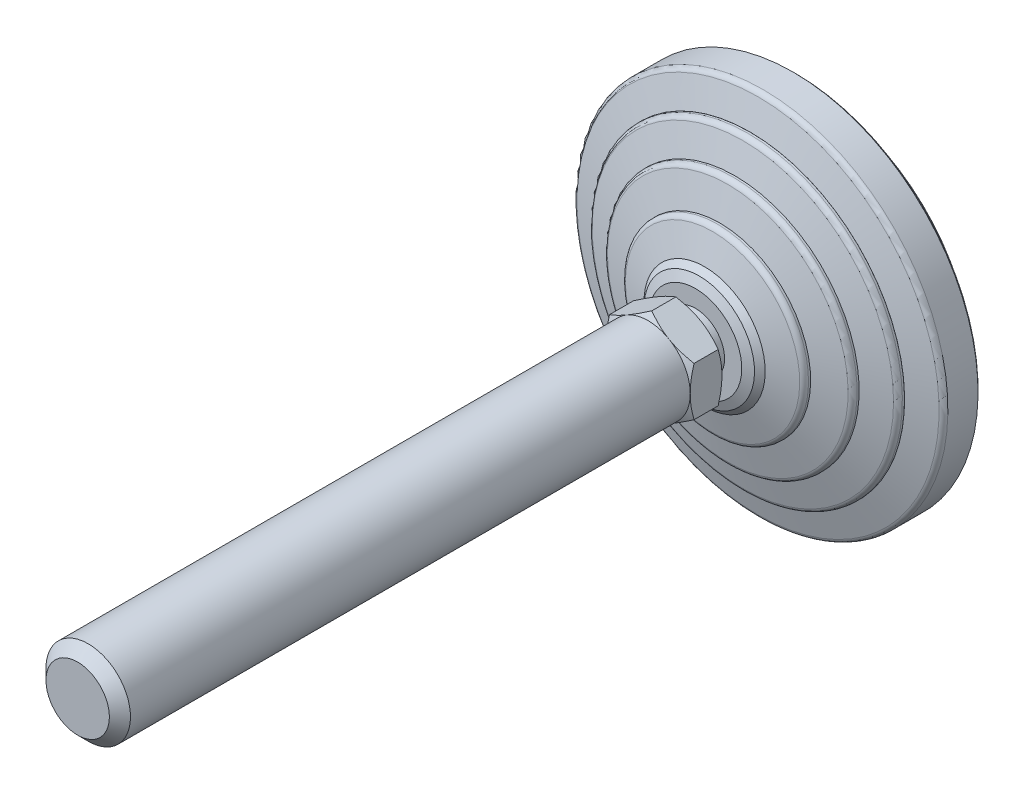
ISO-10303-21;
HEADER;
FILE_DESCRIPTION(('STEP AP214'),'2;1');
FILE_NAME('part.step','',(''),(''),'','','');
FILE_SCHEMA(('AUTOMOTIVE_DESIGN { 1 0 10303 214 1 1 1 1 }'));
ENDSEC;
DATA;
#1=APPLICATION_CONTEXT('core data for automotive mechanical design processes');
#2=APPLICATION_PROTOCOL_DEFINITION('international standard','automotive_design',2000,#1);
#3=PRODUCT_CONTEXT('',#1,'mechanical');
#4=PRODUCT('Part','Part','',(#3));
#5=PRODUCT_RELATED_PRODUCT_CATEGORY('part','',(#4));
#6=PRODUCT_DEFINITION_FORMATION('','',#4);
#7=PRODUCT_DEFINITION_CONTEXT('part definition',#1,'design');
#8=PRODUCT_DEFINITION('design','',#6,#7);
#9=PRODUCT_DEFINITION_SHAPE('','',#8);
#10=(LENGTH_UNIT() NAMED_UNIT(*) SI_UNIT(.MILLI.,.METRE.));
#11=(NAMED_UNIT(*) PLANE_ANGLE_UNIT() SI_UNIT($,.RADIAN.));
#12=(NAMED_UNIT(*) SI_UNIT($,.STERADIAN.) SOLID_ANGLE_UNIT());
#13=UNCERTAINTY_MEASURE_WITH_UNIT(LENGTH_MEASURE(1.E-05),#10,'distance_accuracy_value','');
#14=(GEOMETRIC_REPRESENTATION_CONTEXT(3) GLOBAL_UNCERTAINTY_ASSIGNED_CONTEXT((#13)) GLOBAL_UNIT_ASSIGNED_CONTEXT((#10,
#11,#12)) REPRESENTATION_CONTEXT('',''));
#15=CARTESIAN_POINT('',(0.,0.,0.));
#16=DIRECTION('',(0.,0.,1.));
#17=DIRECTION('',(1.,0.,0.));
#18=AXIS2_PLACEMENT_3D('',#15,#16,#17);
#19=CARTESIAN_POINT('',(0.,0.,22.));
#20=DIRECTION('',(0.,0.,-1.));
#21=DIRECTION('',(0.,1.,0.));
#22=AXIS2_PLACEMENT_3D('',#19,#20,#21);
#23=CONICAL_SURFACE('',#22,8.7540983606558,1.17809724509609);
#24=CARTESIAN_POINT('',(0.,0.,21.2928932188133));
#25=DIRECTION('',(0.,0.,-1.));
#26=DIRECTION('',(0.,1.,0.));
#27=AXIS2_PLACEMENT_3D('',#24,#25,#26);
#28=CIRCLE('',#27,10.4612051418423);
#29=CARTESIAN_POINT('',(0.,10.4612051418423,21.2928932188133));
#30=VERTEX_POINT('',#29);
#31=EDGE_CURVE('E340',#30,#30,#28,.T.);
#32=ORIENTED_EDGE('',*,*,#31,.F.);
#33=EDGE_LOOP('',(#32));
#34=FACE_BOUND('',#33,.T.);
#35=CARTESIAN_POINT('',(0.,0.,22.));
#36=DIRECTION('',(0.,0.,-1.));
#37=DIRECTION('',(0.,1.,0.));
#38=AXIS2_PLACEMENT_3D('',#35,#36,#37);
#39=CIRCLE('',#38,8.7540983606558);
#40=CARTESIAN_POINT('',(0.,8.7540983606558,22.));
#41=VERTEX_POINT('',#40);
#42=EDGE_CURVE('E408',#41,#41,#39,.T.);
#43=ORIENTED_EDGE('',*,*,#42,.T.);
#44=EDGE_LOOP('',(#43));
#45=FACE_BOUND('',#44,.T.);
#46=ADVANCED_FACE('F14',(#34,#45),#23,.T.);
#47=CARTESIAN_POINT('',(0.,0.,21.2928932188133));
#48=DIRECTION('',(0.,0.,-1.));
#49=DIRECTION('',(0.,1.,0.));
#50=AXIS2_PLACEMENT_3D('',#47,#48,#49);
#51=CONICAL_SURFACE('',#50,10.4612051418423,0.785398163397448);
#52=CARTESIAN_POINT('',(0.,0.,20.2786885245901));
#53=DIRECTION('',(0.,0.,-1.));
#54=DIRECTION('',(0.,1.,0.));
#55=AXIS2_PLACEMENT_3D('',#52,#53,#54);
#56=CIRCLE('',#55,11.4754098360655);
#57=CARTESIAN_POINT('',(0.,11.4754098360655,20.2786885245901));
#58=VERTEX_POINT('',#57);
#59=EDGE_CURVE('E337',#58,#58,#56,.T.);
#60=ORIENTED_EDGE('',*,*,#59,.F.);
#61=EDGE_LOOP('',(#60));
#62=FACE_BOUND('',#61,.T.);
#63=ORIENTED_EDGE('',*,*,#31,.T.);
#64=EDGE_LOOP('',(#63));
#65=FACE_BOUND('',#64,.T.);
#66=ADVANCED_FACE('F324',(#62,#65),#51,.T.);
#67=CARTESIAN_POINT('',(0.,0.,20.2786885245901));
#68=DIRECTION('',(0.,0.,-1.));
#69=DIRECTION('',(0.,1.,0.));
#70=AXIS2_PLACEMENT_3D('',#67,#68,#69);
#71=CONICAL_SURFACE('',#70,11.4754098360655,1.27933953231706);
#72=CARTESIAN_POINT('',(0.,0.,18.7711726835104));
#73=DIRECTION('',(0.,0.,-1.));
#74=DIRECTION('',(0.,1.,0.));
#75=AXIS2_PLACEMENT_3D('',#72,#73,#74);
#76=CIRCLE('',#75,16.5004626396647);
#77=CARTESIAN_POINT('',(0.,16.5004626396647,18.7711726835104));
#78=VERTEX_POINT('',#77);
#79=EDGE_CURVE('E346',#78,#78,#76,.T.);
#80=ORIENTED_EDGE('',*,*,#79,.F.);
#81=EDGE_LOOP('',(#80));
#82=FACE_BOUND('',#81,.T.);
#83=ORIENTED_EDGE('',*,*,#59,.T.);
#84=EDGE_LOOP('',(#83));
#85=FACE_BOUND('',#84,.T.);
#86=ADVANCED_FACE('F321',(#82,#85),#71,.T.);
#87=CARTESIAN_POINT('',(0.,0.,17.8133463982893));
#88=DIRECTION('',(0.,0.,-1.));
#89=DIRECTION('',(0.,1.,0.));
#90=AXIS2_PLACEMENT_3D('',#87,#88,#89);
#91=TOROIDAL_SURFACE('',#90,16.2131147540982,1.00000000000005);
#92=CARTESIAN_POINT('',(0.,0.,17.8133463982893));
#93=DIRECTION('',(0.,0.,-1.));
#94=DIRECTION('',(0.,1.,0.));
#95=AXIS2_PLACEMENT_3D('',#92,#93,#94);
#96=CIRCLE('',#95,17.2131147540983);
#97=CARTESIAN_POINT('',(0.,17.2131147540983,17.8133463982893));
#98=VERTEX_POINT('',#97);
#99=EDGE_CURVE('E351',#98,#98,#96,.T.);
#100=ORIENTED_EDGE('',*,*,#99,.F.);
#101=EDGE_LOOP('',(#100));
#102=FACE_BOUND('',#101,.T.);
#103=ORIENTED_EDGE('',*,*,#79,.T.);
#104=EDGE_LOOP('',(#103));
#105=FACE_BOUND('',#104,.T.);
#106=ADVANCED_FACE('F317',(#102,#105),#91,.T.);
#107=CARTESIAN_POINT('',(0.,0.,0.));
#108=DIRECTION('',(0.,0.,-1.));
#109=DIRECTION('',(0.,1.,0.));
#110=AXIS2_PLACEMENT_3D('',#107,#108,#109);
#111=CYLINDRICAL_SURFACE('',#110,17.2131147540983);
#112=CARTESIAN_POINT('',(0.,0.,17.4098360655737));
#113=DIRECTION('',(0.,0.,-1.));
#114=DIRECTION('',(0.,1.,0.));
#115=AXIS2_PLACEMENT_3D('',#112,#113,#114);
#116=CIRCLE('',#115,17.2131147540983);
#117=CARTESIAN_POINT('',(0.,17.2131147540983,17.4098360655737));
#118=VERTEX_POINT('',#117);
#119=EDGE_CURVE('E354',#118,#118,#116,.T.);
#120=ORIENTED_EDGE('',*,*,#119,.F.);
#121=EDGE_LOOP('',(#120));
#122=FACE_BOUND('',#121,.T.);
#123=ORIENTED_EDGE('',*,*,#99,.T.);
#124=EDGE_LOOP('',(#123));
#125=FACE_BOUND('',#124,.T.);
#126=ADVANCED_FACE('F313',(#122,#125),#111,.T.);
#127=CARTESIAN_POINT('',(0.,0.,17.4098360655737));
#128=DIRECTION('',(0.,0.,-1.));
#129=DIRECTION('',(0.,1.,0.));
#130=AXIS2_PLACEMENT_3D('',#127,#128,#129);
#131=CONICAL_SURFACE('',#130,17.2131147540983,1.30454427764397);
#132=CARTESIAN_POINT('',(0.,0.,15.8894925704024));
#133=DIRECTION('',(0.,0.,-1.));
#134=DIRECTION('',(0.,1.,0.));
#135=AXIS2_PLACEMENT_3D('',#132,#133,#134);
#136=CIRCLE('',#135,22.7877075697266);
#137=CARTESIAN_POINT('',(0.,22.7877075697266,15.8894925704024));
#138=VERTEX_POINT('',#137);
#139=EDGE_CURVE('E357',#138,#138,#136,.T.);
#140=ORIENTED_EDGE('',*,*,#139,.F.);
#141=EDGE_LOOP('',(#140));
#142=FACE_BOUND('',#141,.T.);
#143=ORIENTED_EDGE('',*,*,#119,.T.);
#144=EDGE_LOOP('',(#143));
#145=FACE_BOUND('',#144,.T.);
#146=ADVANCED_FACE('F309',(#142,#145),#131,.T.);
#147=CARTESIAN_POINT('',(0.,0.,14.9247287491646));
#148=DIRECTION('',(0.,0.,-1.));
#149=DIRECTION('',(0.,1.,0.));
#150=AXIS2_PLACEMENT_3D('',#147,#148,#149);
#151=TOROIDAL_SURFACE('',#150,22.5245901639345,1.);
#152=CARTESIAN_POINT('',(0.,0.,14.9247287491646));
#153=DIRECTION('',(0.,0.,-1.));
#154=DIRECTION('',(0.,1.,0.));
#155=AXIS2_PLACEMENT_3D('',#152,#153,#154);
#156=CIRCLE('',#155,23.5245901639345);
#157=CARTESIAN_POINT('',(0.,23.5245901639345,14.9247287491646));
#158=VERTEX_POINT('',#157);
#159=EDGE_CURVE('E360',#158,#158,#156,.T.);
#160=ORIENTED_EDGE('',*,*,#159,.F.);
#161=EDGE_LOOP('',(#160));
#162=FACE_BOUND('',#161,.T.);
#163=ORIENTED_EDGE('',*,*,#139,.T.);
#164=EDGE_LOOP('',(#163));
#165=FACE_BOUND('',#164,.T.);
#166=ADVANCED_FACE('F305',(#162,#165),#151,.T.);
#167=CARTESIAN_POINT('',(0.,0.,0.));
#168=DIRECTION('',(0.,0.,-1.));
#169=DIRECTION('',(0.,1.,0.));
#170=AXIS2_PLACEMENT_3D('',#167,#168,#169);
#171=CYLINDRICAL_SURFACE('',#170,23.5245901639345);
#172=CARTESIAN_POINT('',(0.,0.,14.5409836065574));
#173=DIRECTION('',(0.,0.,-1.));
#174=DIRECTION('',(0.,1.,0.));
#175=AXIS2_PLACEMENT_3D('',#172,#173,#174);
#176=CIRCLE('',#175,23.5245901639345);
#177=CARTESIAN_POINT('',(0.,23.5245901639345,14.5409836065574));
#178=VERTEX_POINT('',#177);
#179=EDGE_CURVE('E363',#178,#178,#176,.T.);
#180=ORIENTED_EDGE('',*,*,#179,.F.);
#181=EDGE_LOOP('',(#180));
#182=FACE_BOUND('',#181,.T.);
#183=ORIENTED_EDGE('',*,*,#159,.T.);
#184=EDGE_LOOP('',(#183));
#185=FACE_BOUND('',#184,.T.);
#186=ADVANCED_FACE('F301',(#182,#185),#171,.T.);
#187=CARTESIAN_POINT('',(0.,0.,14.5409836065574));
#188=DIRECTION('',(0.,0.,-1.));
#189=DIRECTION('',(0.,1.,0.));
#190=AXIS2_PLACEMENT_3D('',#187,#188,#189);
#191=CONICAL_SURFACE('',#190,23.5245901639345,1.27871257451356);
#192=CARTESIAN_POINT('',(0.,0.,13.0337743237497));
#193=DIRECTION('',(0.,0.,-1.));
#194=DIRECTION('',(0.,1.,0.));
#195=AXIS2_PLACEMENT_3D('',#192,#193,#194);
#196=CIRCLE('',#195,28.5372004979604);
#197=CARTESIAN_POINT('',(0.,28.5372004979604,13.0337743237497));
#198=VERTEX_POINT('',#197);
#199=EDGE_CURVE('E366',#198,#198,#196,.T.);
#200=ORIENTED_EDGE('',*,*,#199,.F.);
#201=EDGE_LOOP('',(#200));
#202=FACE_BOUND('',#201,.T.);
#203=ORIENTED_EDGE('',*,*,#179,.T.);
#204=EDGE_LOOP('',(#203));
#205=FACE_BOUND('',#204,.T.);
#206=ADVANCED_FACE('F297',(#202,#205),#191,.T.);
#207=CARTESIAN_POINT('',(0.,0.,12.0761283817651));
#208=DIRECTION('',(0.,0.,-1.));
#209=DIRECTION('',(0.,1.,0.));
#210=AXIS2_PLACEMENT_3D('',#207,#208,#209);
#211=TOROIDAL_SURFACE('',#210,28.2492521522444,1.);
#212=CARTESIAN_POINT('',(0.,0.,12.0761283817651));
#213=DIRECTION('',(0.,0.,-1.));
#214=DIRECTION('',(0.,1.,0.));
#215=AXIS2_PLACEMENT_3D('',#212,#213,#214);
#216=CIRCLE('',#215,29.2492521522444);
#217=CARTESIAN_POINT('',(0.,29.2492521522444,12.0761283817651));
#218=VERTEX_POINT('',#217);
#219=EDGE_CURVE('E369',#218,#218,#216,.T.);
#220=ORIENTED_EDGE('',*,*,#219,.F.);
#221=EDGE_LOOP('',(#220));
#222=FACE_BOUND('',#221,.T.);
#223=ORIENTED_EDGE('',*,*,#199,.T.);
#224=EDGE_LOOP('',(#223));
#225=FACE_BOUND('',#224,.T.);
#226=ADVANCED_FACE('F293',(#222,#225),#211,.T.);
#227=CARTESIAN_POINT('',(0.,0.,0.));
#228=DIRECTION('',(0.,0.,-1.));
#229=DIRECTION('',(0.,1.,0.));
#230=AXIS2_PLACEMENT_3D('',#227,#228,#229);
#231=CYLINDRICAL_SURFACE('',#230,29.2492521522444);
#232=CARTESIAN_POINT('',(0.,0.,11.672131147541));
#233=DIRECTION('',(0.,0.,-1.));
#234=DIRECTION('',(0.,1.,0.));
#235=AXIS2_PLACEMENT_3D('',#232,#233,#234);
#236=CIRCLE('',#235,29.2492521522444);
#237=CARTESIAN_POINT('',(0.,29.2492521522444,11.672131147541));
#238=VERTEX_POINT('',#237);
#239=EDGE_CURVE('E372',#238,#238,#236,.T.);
#240=ORIENTED_EDGE('',*,*,#239,.F.);
#241=EDGE_LOOP('',(#240));
#242=FACE_BOUND('',#241,.T.);
#243=ORIENTED_EDGE('',*,*,#219,.T.);
#244=EDGE_LOOP('',(#243));
#245=FACE_BOUND('',#244,.T.);
#246=ADVANCED_FACE('F289',(#242,#245),#231,.T.);
#247=CARTESIAN_POINT('',(-29.2622950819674,0.,11.672131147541));
#248=DIRECTION('',(0.,0.,-1.));
#249=DIRECTION('',(0.,1.,0.));
#250=AXIS2_PLACEMENT_3D('',#247,#248,#249);
#251=PLANE('',#250);
#252=CARTESIAN_POINT('',(0.,0.,11.672131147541));
#253=DIRECTION('',(0.,0.,-1.));
#254=DIRECTION('',(0.,1.,0.));
#255=AXIS2_PLACEMENT_3D('',#252,#253,#254);
#256=CIRCLE('',#255,29.2622950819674);
#257=CARTESIAN_POINT('',(0.,29.2622950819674,11.672131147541));
#258=VERTEX_POINT('',#257);
#259=EDGE_CURVE('E375',#258,#258,#256,.T.);
#260=ORIENTED_EDGE('',*,*,#259,.F.);
#261=EDGE_LOOP('',(#260));
#262=FACE_BOUND('',#261,.T.);
#263=ORIENTED_EDGE('',*,*,#239,.T.);
#264=EDGE_LOOP('',(#263));
#265=FACE_BOUND('',#264,.T.);
#266=ADVANCED_FACE('F285',(#262,#265),#251,.F.);
#267=CARTESIAN_POINT('',(0.,0.,11.672131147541));
#268=DIRECTION('',(0.,0.,-1.));
#269=DIRECTION('',(0.,1.,0.));
#270=AXIS2_PLACEMENT_3D('',#267,#268,#269);
#271=CONICAL_SURFACE('',#270,29.2622950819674,1.27933953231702);
#272=CARTESIAN_POINT('',(0.,0.,10.1646153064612));
#273=DIRECTION('',(0.,0.,-1.));
#274=DIRECTION('',(0.,1.,0.));
#275=AXIS2_PLACEMENT_3D('',#272,#273,#274);
#276=CIRCLE('',#275,34.2873478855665);
#277=CARTESIAN_POINT('',(0.,34.2873478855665,10.1646153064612));
#278=VERTEX_POINT('',#277);
#279=EDGE_CURVE('E378',#278,#278,#276,.T.);
#280=ORIENTED_EDGE('',*,*,#279,.F.);
#281=EDGE_LOOP('',(#280));
#282=FACE_BOUND('',#281,.T.);
#283=ORIENTED_EDGE('',*,*,#259,.T.);
#284=EDGE_LOOP('',(#283));
#285=FACE_BOUND('',#284,.T.);
#286=ADVANCED_FACE('F281',(#282,#285),#271,.T.);
#287=CARTESIAN_POINT('',(0.,0.,9.20678902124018));
#288=DIRECTION('',(0.,0.,-1.));
#289=DIRECTION('',(0.,1.,0.));
#290=AXIS2_PLACEMENT_3D('',#287,#288,#289);
#291=TOROIDAL_SURFACE('',#290,34.,0.999999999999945);
#292=CARTESIAN_POINT('',(0.,0.,9.20678902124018));
#293=DIRECTION('',(0.,0.,-1.));
#294=DIRECTION('',(0.,1.,0.));
#295=AXIS2_PLACEMENT_3D('',#292,#293,#294);
#296=CIRCLE('',#295,35.);
#297=CARTESIAN_POINT('',(0.,35.,9.20678902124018));
#298=VERTEX_POINT('',#297);
#299=EDGE_CURVE('E381',#298,#298,#296,.T.);
#300=ORIENTED_EDGE('',*,*,#299,.F.);
#301=EDGE_LOOP('',(#300));
#302=FACE_BOUND('',#301,.T.);
#303=ORIENTED_EDGE('',*,*,#279,.T.);
#304=EDGE_LOOP('',(#303));
#305=FACE_BOUND('',#304,.T.);
#306=ADVANCED_FACE('F277',(#302,#305),#291,.T.);
#307=CARTESIAN_POINT('',(0.,0.,0.));
#308=DIRECTION('',(0.,0.,-1.));
#309=DIRECTION('',(0.,1.,0.));
#310=AXIS2_PLACEMENT_3D('',#307,#308,#309);
#311=CYLINDRICAL_SURFACE('',#310,35.);
#312=CARTESIAN_POINT('',(0.,0.,3.5));
#313=DIRECTION('',(0.,0.,-1.));
#314=DIRECTION('',(0.,1.,0.));
#315=AXIS2_PLACEMENT_3D('',#312,#313,#314);
#316=CIRCLE('',#315,35.);
#317=CARTESIAN_POINT('',(0.,35.,3.5));
#318=VERTEX_POINT('',#317);
#319=EDGE_CURVE('E384',#318,#318,#316,.T.);
#320=ORIENTED_EDGE('',*,*,#319,.F.);
#321=EDGE_LOOP('',(#320));
#322=FACE_BOUND('',#321,.T.);
#323=ORIENTED_EDGE('',*,*,#299,.T.);
#324=EDGE_LOOP('',(#323));
#325=FACE_BOUND('',#324,.T.);
#326=ADVANCED_FACE('F273',(#322,#325),#311,.T.);
#327=CARTESIAN_POINT('',(0.,0.,3.5));
#328=DIRECTION('',(0.,0.,1.));
#329=DIRECTION('',(0.,-1.,0.));
#330=AXIS2_PLACEMENT_3D('',#327,#328,#329);
#331=CONICAL_SURFACE('',#330,35.,0.785398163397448);
#332=CARTESIAN_POINT('',(0.,0.,3.));
#333=DIRECTION('',(0.,0.,-1.));
#334=DIRECTION('',(0.,1.,0.));
#335=AXIS2_PLACEMENT_3D('',#332,#333,#334);
#336=CIRCLE('',#335,34.5);
#337=CARTESIAN_POINT('',(0.,34.5,3.));
#338=VERTEX_POINT('',#337);
#339=EDGE_CURVE('E387',#338,#338,#336,.T.);
#340=ORIENTED_EDGE('',*,*,#339,.F.);
#341=EDGE_LOOP('',(#340));
#342=FACE_BOUND('',#341,.T.);
#343=ORIENTED_EDGE('',*,*,#319,.T.);
#344=EDGE_LOOP('',(#343));
#345=FACE_BOUND('',#344,.T.);
#346=ADVANCED_FACE('F269',(#342,#345),#331,.T.);
#347=CARTESIAN_POINT('',(-34.5,0.,3.));
#348=DIRECTION('',(0.,0.,1.));
#349=DIRECTION('',(0.,-1.,0.));
#350=AXIS2_PLACEMENT_3D('',#347,#348,#349);
#351=PLANE('',#350);
#352=CARTESIAN_POINT('',(0.,0.,3.));
#353=DIRECTION('',(0.,0.,-1.));
#354=DIRECTION('',(0.,1.,0.));
#355=AXIS2_PLACEMENT_3D('',#352,#353,#354);
#356=CIRCLE('',#355,30.4098360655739);
#357=CARTESIAN_POINT('',(0.,30.4098360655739,3.));
#358=VERTEX_POINT('',#357);
#359=EDGE_CURVE('E390',#358,#358,#356,.T.);
#360=ORIENTED_EDGE('',*,*,#359,.F.);
#361=EDGE_LOOP('',(#360));
#362=FACE_BOUND('',#361,.T.);
#363=ORIENTED_EDGE('',*,*,#339,.T.);
#364=EDGE_LOOP('',(#363));
#365=FACE_BOUND('',#364,.T.);
#366=ADVANCED_FACE('F265',(#362,#365),#351,.F.);
#367=CARTESIAN_POINT('',(0.,0.,0.));
#368=DIRECTION('',(0.,0.,-1.));
#369=DIRECTION('',(0.,1.,0.));
#370=AXIS2_PLACEMENT_3D('',#367,#368,#369);
#371=CYLINDRICAL_SURFACE('',#370,30.4098360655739);
#372=CARTESIAN_POINT('',(0.,0.,0.));
#373=DIRECTION('',(0.,0.,-1.));
#374=DIRECTION('',(0.,1.,0.));
#375=AXIS2_PLACEMENT_3D('',#372,#373,#374);
#376=CIRCLE('',#375,30.4098360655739);
#377=CARTESIAN_POINT('',(0.,30.4098360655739,0.));
#378=VERTEX_POINT('',#377);
#379=EDGE_CURVE('E393',#378,#378,#376,.T.);
#380=ORIENTED_EDGE('',*,*,#379,.F.);
#381=EDGE_LOOP('',(#380));
#382=FACE_BOUND('',#381,.T.);
#383=ORIENTED_EDGE('',*,*,#359,.T.);
#384=EDGE_LOOP('',(#383));
#385=FACE_BOUND('',#384,.T.);
#386=ADVANCED_FACE('F261',(#382,#385),#371,.T.);
#387=CARTESIAN_POINT('',(-30.4098360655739,0.,0.));
#388=DIRECTION('',(0.,0.,1.));
#389=DIRECTION('',(0.,-1.,0.));
#390=AXIS2_PLACEMENT_3D('',#387,#388,#389);
#391=PLANE('',#390);
#392=ORIENTED_EDGE('',*,*,#379,.T.);
#393=EDGE_LOOP('',(#392));
#394=FACE_BOUND('',#393,.T.);
#395=ADVANCED_FACE('F244',(#394),#391,.F.);
#396=CARTESIAN_POINT('',(-7.76470588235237,0.,24.9999999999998));
#397=DIRECTION('',(0.,0.,1.));
#398=DIRECTION('',(0.,-1.,0.));
#399=AXIS2_PLACEMENT_3D('',#396,#397,#398);
#400=PLANE('',#399);
#401=CARTESIAN_POINT('',(0.,0.,24.9999999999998));
#402=DIRECTION('',(0.,0.,-1.));
#403=DIRECTION('',(0.,1.,0.));
#404=AXIS2_PLACEMENT_3D('',#401,#402,#403);
#405=CIRCLE('',#404,5.50000000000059);
#406=CARTESIAN_POINT('',(0.,5.50000000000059,24.9999999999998));
#407=VERTEX_POINT('',#406);
#408=EDGE_CURVE('E402',#407,#407,#405,.T.);
#409=ORIENTED_EDGE('',*,*,#408,.F.);
#410=EDGE_LOOP('',(#409));
#411=FACE_BOUND('',#410,.T.);
#412=CARTESIAN_POINT('',(0.,0.,24.9999999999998));
#413=DIRECTION('',(0.,0.,-1.));
#414=DIRECTION('',(-1.,0.,0.));
#415=AXIS2_PLACEMENT_3D('',#412,#413,#414);
#416=CIRCLE('',#415,8.00000000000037);
#417=CARTESIAN_POINT('',(4.,6.92820323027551,24.9999999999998));
#418=VERTEX_POINT('',#417);
#419=CARTESIAN_POINT('',(8.,0.,24.9999999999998));
#420=VERTEX_POINT('',#419);
#421=EDGE_CURVE('E505',#418,#420,#416,.T.);
#422=ORIENTED_EDGE('',*,*,#421,.T.);
#423=CARTESIAN_POINT('',(4.,-6.92820323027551,24.9999999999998));
#424=VERTEX_POINT('',#423);
#425=EDGE_CURVE('E140',#420,#424,#416,.T.);
#426=ORIENTED_EDGE('',*,*,#425,.T.);
#427=CARTESIAN_POINT('',(-4.,-6.92820323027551,24.9999999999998));
#428=VERTEX_POINT('',#427);
#429=EDGE_CURVE('E139',#424,#428,#416,.T.);
#430=ORIENTED_EDGE('',*,*,#429,.T.);
#431=CARTESIAN_POINT('',(-8.,0.,24.9999999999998));
#432=VERTEX_POINT('',#431);
#433=EDGE_CURVE('E116',#428,#432,#416,.T.);
#434=ORIENTED_EDGE('',*,*,#433,.T.);
#435=CARTESIAN_POINT('',(-4.,6.92820323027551,24.9999999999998));
#436=VERTEX_POINT('',#435);
#437=EDGE_CURVE('E104',#432,#436,#416,.T.);
#438=ORIENTED_EDGE('',*,*,#437,.T.);
#439=EDGE_CURVE('E33',#436,#418,#416,.T.);
#440=ORIENTED_EDGE('',*,*,#439,.T.);
#441=EDGE_LOOP('',(#422,#426,#430,#434,#438,#440));
#442=FACE_BOUND('',#441,.T.);
#443=ADVANCED_FACE('F137',(#411,#442),#400,.F.);
#444=CARTESIAN_POINT('',(0.,0.,0.));
#445=DIRECTION('',(0.,0.,-1.));
#446=DIRECTION('',(0.,1.,0.));
#447=AXIS2_PLACEMENT_3D('',#444,#445,#446);
#448=CYLINDRICAL_SURFACE('',#447,5.50000000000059);
#449=CARTESIAN_POINT('',(0.,0.,22.));
#450=DIRECTION('',(0.,0.,-1.));
#451=DIRECTION('',(0.,1.,0.));
#452=AXIS2_PLACEMENT_3D('',#449,#450,#451);
#453=CIRCLE('',#452,5.50000000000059);
#454=CARTESIAN_POINT('',(0.,5.50000000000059,22.));
#455=VERTEX_POINT('',#454);
#456=EDGE_CURVE('E405',#455,#455,#453,.T.);
#457=ORIENTED_EDGE('',*,*,#456,.F.);
#458=EDGE_LOOP('',(#457));
#459=FACE_BOUND('',#458,.T.);
#460=ORIENTED_EDGE('',*,*,#408,.T.);
#461=EDGE_LOOP('',(#460));
#462=FACE_BOUND('',#461,.T.);
#463=ADVANCED_FACE('F237',(#459,#462),#448,.T.);
#464=CARTESIAN_POINT('',(-8.7540983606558,0.,22.));
#465=DIRECTION('',(0.,0.,-1.));
#466=DIRECTION('',(0.,1.,0.));
#467=AXIS2_PLACEMENT_3D('',#464,#465,#466);
#468=PLANE('',#467);
#469=ORIENTED_EDGE('',*,*,#42,.F.);
#470=EDGE_LOOP('',(#469));
#471=FACE_BOUND('',#470,.T.);
#472=ORIENTED_EDGE('',*,*,#456,.T.);
#473=EDGE_LOOP('',(#472));
#474=FACE_BOUND('',#473,.T.);
#475=ADVANCED_FACE('F233',(#471,#474),#468,.F.);
#476=CARTESIAN_POINT('',(0.,0.,26.5193121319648));
#477=DIRECTION('',(0.,0.,1.));
#478=DIRECTION('',(1.,0.,0.));
#479=AXIS2_PLACEMENT_3D('',#476,#477,#478);
#480=CONICAL_SURFACE('',#479,10.6315258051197,1.0471975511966);
#481=CARTESIAN_POINT('',(8.,-12.3617214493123,28.8824165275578));
#482=CARTESIAN_POINT('',(8.,-12.0126889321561,28.7132856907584));
#483=CARTESIAN_POINT('',(8.,-11.6628503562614,28.5457895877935));
#484=CARTESIAN_POINT('',(8.,-10.9611322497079,28.214987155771));
#485=CARTESIAN_POINT('',(8.,-10.6092524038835,28.0516814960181));
#486=CARTESIAN_POINT('',(8.,-9.90118821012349,27.7293490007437));
#487=CARTESIAN_POINT('',(8.,-9.5449908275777,27.5703506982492));
#488=CARTESIAN_POINT('',(8.,-8.8297473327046,27.2589210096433));
#489=CARTESIAN_POINT('',(8.,-8.47070135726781,27.1064893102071));
#490=CARTESIAN_POINT('',(8.,-7.73776285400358,26.8052314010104));
#491=CARTESIAN_POINT('',(8.,-7.36376006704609,26.6566719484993));
#492=CARTESIAN_POINT('',(8.,-6.61136320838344,26.3709057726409));
#493=CARTESIAN_POINT('',(8.,-6.23296864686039,26.2337003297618));
#494=CARTESIAN_POINT('',(8.,-5.47190461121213,25.9742775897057));
#495=CARTESIAN_POINT('',(8.,-5.08924572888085,25.8520295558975));
#496=CARTESIAN_POINT('',(8.,-4.318453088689,25.6264723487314));
#497=CARTESIAN_POINT('',(8.,-3.93032111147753,25.5231571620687));
#498=CARTESIAN_POINT('',(8.,-3.1504491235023,25.3410089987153));
#499=CARTESIAN_POINT('',(8.,-2.75874066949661,25.2620445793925));
#500=CARTESIAN_POINT('',(8.,-2.16764713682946,25.1653005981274));
#501=CARTESIAN_POINT('',(8.,-1.97001258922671,25.1366683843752));
#502=CARTESIAN_POINT('',(8.,-1.57377651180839,25.0872007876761));
#503=CARTESIAN_POINT('',(8.,-1.37517507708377,25.0663646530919));
#504=CARTESIAN_POINT('',(8.,-0.979845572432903,25.0331632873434));
#505=CARTESIAN_POINT('',(8.,-0.783126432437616,25.0206921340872));
#506=CARTESIAN_POINT('',(8.,-0.389337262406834,25.0040767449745));
#507=CARTESIAN_POINT('',(8.,-0.192267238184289,24.999932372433));
#508=CARTESIAN_POINT('',(8.,0.201871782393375,25.0000692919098));
#509=CARTESIAN_POINT('',(8.,0.398940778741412,25.0043506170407));
#510=CARTESIAN_POINT('',(8.,0.792724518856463,25.0212350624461));
#511=CARTESIAN_POINT('',(8.,0.989439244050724,25.0338386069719));
#512=CARTESIAN_POINT('',(8.,1.46358788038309,25.0739821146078));
#513=CARTESIAN_POINT('',(8.,1.74068802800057,25.1055474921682));
#514=CARTESIAN_POINT('',(8.,2.2927888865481,25.1834589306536));
#515=CARTESIAN_POINT('',(8.,2.56778930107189,25.2298070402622));
#516=CARTESIAN_POINT('',(8.,3.38935146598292,25.3885641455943));
#517=CARTESIAN_POINT('',(8.,3.93215774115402,25.5206556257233));
#518=CARTESIAN_POINT('',(8.,4.74371381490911,25.7491699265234));
#519=CARTESIAN_POINT('',(8.,5.01668716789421,25.8314511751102));
#520=CARTESIAN_POINT('',(8.,5.55998177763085,26.0044252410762));
#521=CARTESIAN_POINT('',(8.,5.83030301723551,26.0951181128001));
#522=CARTESIAN_POINT('',(8.,6.36838079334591,26.2834715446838));
#523=CARTESIAN_POINT('',(8.,6.63613817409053,26.3811297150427));
#524=CARTESIAN_POINT('',(8.,7.16944386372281,26.5822781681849));
#525=CARTESIAN_POINT('',(8.,7.43499219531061,26.685768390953));
#526=CARTESIAN_POINT('',(8.,8.04829503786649,26.9313082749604));
#527=CARTESIAN_POINT('',(8.,8.39532983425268,27.0751519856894));
#528=CARTESIAN_POINT('',(8.,9.08655136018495,27.3695457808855));
#529=CARTESIAN_POINT('',(8.,9.43073793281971,27.5200962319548));
#530=CARTESIAN_POINT('',(8.,10.1167687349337,27.8265948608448));
#531=CARTESIAN_POINT('',(8.,10.4586125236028,27.9825440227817));
#532=CARTESIAN_POINT('',(8.,11.1402862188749,28.2987909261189));
#533=CARTESIAN_POINT('',(8.,11.4801160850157,28.459088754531));
#534=CARTESIAN_POINT('',(8.,12.1584134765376,28.7833967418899));
#535=CARTESIAN_POINT('',(8.,12.4968793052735,28.9474104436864));
#536=CARTESIAN_POINT('',(8.,13.1723709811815,29.2783794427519));
#537=CARTESIAN_POINT('',(8.,13.5093968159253,29.4453347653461));
#538=CARTESIAN_POINT('',(8.,14.5185674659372,29.9498093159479));
#539=CARTESIAN_POINT('',(8.,15.1888883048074,30.2909770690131));
#540=CARTESIAN_POINT('',(8.,16.4720613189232,30.9524265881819));
#541=CARTESIAN_POINT('',(8.,17.0851897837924,31.2721747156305));
#542=CARTESIAN_POINT('',(8.,18.3091448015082,31.9160908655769));
#543=CARTESIAN_POINT('',(8.,18.9199712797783,32.240259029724));
#544=CARTESIAN_POINT('',(8.,20.1383856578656,32.8912102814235));
#545=CARTESIAN_POINT('',(8.,20.745977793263,33.2179854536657));
#546=CARTESIAN_POINT('',(8.,21.959681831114,33.8741992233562));
#547=CARTESIAN_POINT('',(8.,22.5657938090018,34.2036376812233));
#548=CARTESIAN_POINT('',(8.,23.1713570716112,34.5340749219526));
#549=B_SPLINE_CURVE_WITH_KNOTS('',3,(#481,#482,#483,#484,#485,#486,#487,#488,#489,#490,#491,
#492,#493,#494,#495,#496,#497,#498,#499,#500,#501,#502,#503,#504,#505,#506,#507,#508,#509,#510,
#511,#512,#513,#514,#515,#516,#517,#518,#519,#520,#521,#522,#523,#524,#525,#526,#527,#528,#529,
#530,#531,#532,#533,#534,#535,#536,#537,#538,#539,#540,#541,#542,#543,#544,#545,#546,#547,#548),
.UNSPECIFIED.,.F.,.F.,(4,2,2,2,2,2,2,2,2,2,2,2,2,2,2,2,2,2,2,2,2,2,2,2,2,2,2,2,2,2,2,2,2,4),(0.,
1.1635695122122,2.32732372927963,3.49748998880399,4.66760035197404,5.87474022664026,
7.08201605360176,8.28676777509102,9.49113618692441,10.6888849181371,11.2878487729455,
11.8867548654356,12.4779264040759,13.0690882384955,13.6602523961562,14.2514466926,
15.0876498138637,15.9239688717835,17.5975562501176,18.4528005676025,19.3080504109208,
20.1630082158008,21.0179572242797,22.1448586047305,23.2718216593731,24.3989912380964,
25.5261833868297,26.6544996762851,27.7828256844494,30.0392017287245,32.1136675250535,
34.1881999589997,36.257867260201,38.3274267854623),.UNSPECIFIED.);
#550=CARTESIAN_POINT('',(8.,4.61880215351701,25.7145311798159));
#551=VERTEX_POINT('',#550);
#552=EDGE_CURVE('E114',#551,#420,#549,.F.);
#553=ORIENTED_EDGE('',*,*,#552,.T.);
#554=ORIENTED_EDGE('',*,*,#421,.F.);
#555=CARTESIAN_POINT('',(-1.0796251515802,9.86092617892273,26.1084268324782));
#556=CARTESIAN_POINT('',(-0.882874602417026,9.74733219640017,26.0308884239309));
#557=CARTESIAN_POINT('',(-0.685335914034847,9.63328318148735,25.9559334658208));
#558=CARTESIAN_POINT('',(-0.288523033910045,9.40418315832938,25.8121202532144));
#559=CARTESIAN_POINT('',(-0.0892482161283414,9.2891317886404,25.7432643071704));
#560=CARTESIAN_POINT('',(0.311882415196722,9.05753891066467,25.6123665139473));
#561=CARTESIAN_POINT('',(0.513745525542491,8.94099318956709,25.5503542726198));
#562=CARTESIAN_POINT('',(0.919227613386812,8.7068879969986,25.4345838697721));
#563=CARTESIAN_POINT('',(1.12284640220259,8.58932863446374,25.3808248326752));
#564=CARTESIAN_POINT('',(1.52545403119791,8.3568830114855,25.2842226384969));
#565=CARTESIAN_POINT('',(1.72439097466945,8.24202671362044,25.2410929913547));
#566=CARTESIAN_POINT('',(2.123676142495,8.01149931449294,25.1646895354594));
#567=CARTESIAN_POINT('',(2.32402426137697,7.8958282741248,25.1314149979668));
#568=CARTESIAN_POINT('',(2.72547356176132,7.66405141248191,25.0756843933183));
#569=CARTESIAN_POINT('',(2.92657261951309,7.54794681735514,25.053208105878));
#570=CARTESIAN_POINT('',(3.32948493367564,7.31532528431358,25.019667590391));
#571=CARTESIAN_POINT('',(3.53129816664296,7.19880835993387,25.0086029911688));
#572=CARTESIAN_POINT('',(3.92298541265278,6.97266762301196,24.9985548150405));
#573=CARTESIAN_POINT('',(4.11284632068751,6.86305137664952,24.9988836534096));
#574=CARTESIAN_POINT('',(4.49234041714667,6.64395035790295,25.0099227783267));
#575=CARTESIAN_POINT('',(4.68197360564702,6.53446558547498,25.0206330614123));
#576=CARTESIAN_POINT('',(5.06091166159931,6.31568559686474,25.0521546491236));
#577=CARTESIAN_POINT('',(5.25021550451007,6.20639097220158,25.0729822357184));
#578=CARTESIAN_POINT('',(5.62784220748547,5.98836809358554,25.1241769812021));
#579=CARTESIAN_POINT('',(5.81616507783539,5.87963983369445,25.1545440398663));
#580=CARTESIAN_POINT('',(6.39035676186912,5.54813011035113,25.2609111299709));
#581=CARTESIAN_POINT('',(6.77423585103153,5.32649741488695,25.351181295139));
#582=CARTESIAN_POINT('',(7.53468234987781,4.88745342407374,25.5612543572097));
#583=CARTESIAN_POINT('',(7.91126891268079,4.67003107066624,25.6809637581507));
#584=CARTESIAN_POINT('',(8.28436535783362,4.45462373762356,25.8118019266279));
#585=B_SPLINE_CURVE_WITH_KNOTS('',3,(#555,#556,#557,#558,#559,#560,#561,#562,#563,#564,#565,
#566,#567,#568,#569,#570,#571,#572,#573,#574,#575,#576,#577,#578,#579,#580,#581,#582,#583,#584),
.UNSPECIFIED.,.F.,.F.,(4,2,2,2,2,2,2,2,2,2,2,2,2,2,4),(0.,0.72019053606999,1.44065250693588,
2.16411819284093,2.88750707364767,3.58849376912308,4.28942861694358,4.98904576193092,
5.68864015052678,6.3460925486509,7.00354472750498,7.66205847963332,8.32056531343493,
9.67639934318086,11.0279817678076),.UNSPECIFIED.);
#586=EDGE_CURVE('E17',#418,#551,#585,.T.);
#587=ORIENTED_EDGE('',*,*,#586,.T.);
#588=EDGE_LOOP('',(#553,#554,#587));
#589=FACE_BOUND('',#588,.T.);
#590=ADVANCED_FACE('F157',(#589),#480,.T.);
#591=CARTESIAN_POINT('',(-14.4779446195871,0.87875908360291,28.7554261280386));
#592=CARTESIAN_POINT('',(-14.1720816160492,1.05534917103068,28.5853895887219));
#593=CARTESIAN_POINT('',(-13.8654742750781,1.23236900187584,28.4171042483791));
#594=CARTESIAN_POINT('',(-13.2503620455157,1.58750421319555,28.0850528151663));
#595=CARTESIAN_POINT('',(-12.9418568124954,1.76561979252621,27.9212875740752));
#596=CARTESIAN_POINT('',(-12.3207221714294,2.12423204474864,27.5983531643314));
#597=CARTESIAN_POINT('',(-12.0080790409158,2.30473664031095,27.4392190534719));
#598=CARTESIAN_POINT('',(-11.3801382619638,2.66727841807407,27.1281231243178));
#599=CARTESIAN_POINT('',(-11.0648407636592,2.84931551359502,26.9761609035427));
#600=CARTESIAN_POINT('',(-10.4281160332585,3.21692870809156,26.6799865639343));
#601=CARTESIAN_POINT('',(-10.1066590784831,3.40252196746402,26.5358591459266));
#602=CARTESIAN_POINT('',(-9.45985077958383,3.7759569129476,26.2595310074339));
#603=CARTESIAN_POINT('',(-9.1344989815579,3.9637988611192,26.1273316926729));
#604=CARTESIAN_POINT('',(-8.48012879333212,4.34159966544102,25.8786511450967));
#605=CARTESIAN_POINT('',(-8.15112097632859,4.5315524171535,25.7621332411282));
#606=CARTESIAN_POINT('',(-7.48840416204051,4.91417214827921,25.5488241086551));
#607=CARTESIAN_POINT('',(-7.1546968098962,5.10683817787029,25.4520261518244));
#608=CARTESIAN_POINT('',(-6.48608311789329,5.49286247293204,25.2840767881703));
#609=CARTESIAN_POINT('',(-6.15122781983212,5.68619126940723,25.2126620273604));
#610=CARTESIAN_POINT('',(-5.64618757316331,5.97777639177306,25.1273464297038));
#611=CARTESIAN_POINT('',(-5.47735916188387,6.0752495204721,25.1025405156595));
#612=CARTESIAN_POINT('',(-5.1389877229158,6.27060836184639,25.0606889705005));
#613=CARTESIAN_POINT('',(-4.96944476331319,6.36849403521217,25.0436426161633));
#614=CARTESIAN_POINT('',(-4.63083834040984,6.56398854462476,25.0177591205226));
#615=CARTESIAN_POINT('',(-4.46177748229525,6.66159587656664,25.0088766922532));
#616=CARTESIAN_POINT('',(-4.12348272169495,6.85691044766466,24.9993596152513));
#617=CARTESIAN_POINT('',(-3.95424882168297,6.95461768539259,24.9987248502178));
#618=CARTESIAN_POINT('',(-3.61595182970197,7.14993354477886,25.0057179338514));
#619=CARTESIAN_POINT('',(-3.44688870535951,7.24754218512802,25.0133436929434));
#620=CARTESIAN_POINT('',(-3.1091786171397,7.44251919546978,25.0366767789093));
#621=CARTESIAN_POINT('',(-2.94053167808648,7.53988755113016,25.0523845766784));
#622=CARTESIAN_POINT('',(-2.52475644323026,7.77993549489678,25.1007566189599));
#623=CARTESIAN_POINT('',(-2.27801382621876,7.92239241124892,25.1379210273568));
#624=CARTESIAN_POINT('',(-1.7866098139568,8.20610465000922,25.2274183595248));
#625=CARTESIAN_POINT('',(-1.54194876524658,8.34735977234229,25.2797537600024));
#626=CARTESIAN_POINT('',(-0.810586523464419,8.76961195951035,25.4568708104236));
#627=CARTESIAN_POINT('',(-0.327480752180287,9.0485332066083,25.6016359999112));
#628=CARTESIAN_POINT('',(0.394766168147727,9.46552266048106,25.8490881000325));
#629=CARTESIAN_POINT('',(0.637723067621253,9.60579389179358,25.9377513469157));
#630=CARTESIAN_POINT('',(1.12129092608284,9.88498192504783,26.1233828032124));
#631=CARTESIAN_POINT('',(1.36190168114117,10.0238986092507,26.2203517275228));
#632=CARTESIAN_POINT('',(1.83957038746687,10.2996807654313,26.4205582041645));
#633=CARTESIAN_POINT('',(2.07664081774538,10.4365534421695,26.5237564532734));
#634=CARTESIAN_POINT('',(2.54879945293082,10.709154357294,26.7357809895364));
#635=CARTESIAN_POINT('',(2.78388829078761,10.8448829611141,26.8446053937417));
#636=CARTESIAN_POINT('',(3.01814837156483,10.9801330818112,26.9557077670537));
#637=B_SPLINE_CURVE_WITH_KNOTS('',3,(#591,#592,#593,#594,#595,#596,#597,#598,#599,#600,#601,
#602,#603,#604,#605,#606,#607,#608,#609,#610,#611,#612,#613,#614,#615,#616,#617,#618,#619,#620,
#621,#622,#623,#624,#625,#626,#627,#628,#629,#630,#631,#632,#633,#634,#635,#636),.UNSPECIFIED.,
.F.,.F.,(4,2,2,2,2,2,2,2,2,2,2,2,2,2,2,2,2,2,2,2,2,2,4),(0.,1.17595853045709,2.35213716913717,
3.53565545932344,4.71910725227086,5.91350710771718,7.10804753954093,8.29974409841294,
9.49103337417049,10.6695749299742,11.2589988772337,11.8483678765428,12.4344474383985,
13.0205187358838,13.6064418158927,14.1923990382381,15.0538864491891,15.9155145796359,
17.6421533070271,18.5247513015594,19.4074253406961,20.285017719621,21.1623182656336),.UNSPECIFIED.);
#638=CARTESIAN_POINT('',(0.,9.23760430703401,25.7145311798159));
#639=VERTEX_POINT('',#638);
#640=EDGE_CURVE('E149',#436,#639,#637,.T.);
#641=ORIENTED_EDGE('',*,*,#640,.T.);
#642=EDGE_CURVE('E9',#639,#418,#585,.T.);
#643=ORIENTED_EDGE('',*,*,#642,.T.);
#644=ORIENTED_EDGE('',*,*,#439,.F.);
#645=EDGE_LOOP('',(#641,#643,#644));
#646=FACE_BOUND('',#645,.T.);
#647=ADVANCED_FACE('F498',(#646),#480,.T.);
#648=CARTESIAN_POINT('',(-6.48448734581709,-12.9814248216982,28.7590648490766));
#649=CARTESIAN_POINT('',(-6.1786663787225,-12.8048590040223,28.5890192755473));
#650=CARTESIAN_POINT('',(-5.87210215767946,-12.6278640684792,28.42072209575));
#651=CARTESIAN_POINT('',(-5.25707916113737,-12.2727803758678,28.0886391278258));
#652=CARTESIAN_POINT('',(-4.94862004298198,-12.0946914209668,27.9248541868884));
#653=CARTESIAN_POINT('',(-4.32758815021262,-11.7361384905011,27.6018734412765));
#654=CARTESIAN_POINT('',(-4.01500172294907,-11.5556666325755,27.4427125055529));
#655=CARTESIAN_POINT('',(-3.38717857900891,-11.1931927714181,27.1315485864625));
#656=CARTESIAN_POINT('',(-3.07194201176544,-11.0111908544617,26.979545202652));
#657=CARTESIAN_POINT('',(-2.43530052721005,-10.6436257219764,26.6832483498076));
#658=CARTESIAN_POINT('',(-2.11386548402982,-10.4580451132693,26.5390406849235));
#659=CARTESIAN_POINT('',(-1.46710553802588,-10.0846380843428,26.2625297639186));
#660=CARTESIAN_POINT('',(-1.14178018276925,-9.89681140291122,26.1302279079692));
#661=CARTESIAN_POINT('',(-0.487463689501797,-9.51904159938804,25.8813126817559));
#662=CARTESIAN_POINT('',(-0.158483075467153,-9.32910455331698,25.7646628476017));
#663=CARTESIAN_POINT('',(0.504178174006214,-8.94651690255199,25.5510553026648));
#664=CARTESIAN_POINT('',(0.837857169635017,-8.75386724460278,25.4540908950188));
#665=CARTESIAN_POINT('',(1.50653805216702,-8.36780415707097,25.2857426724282));
#666=CARTESIAN_POINT('',(1.84149055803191,-8.17441923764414,25.2141046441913));
#667=CARTESIAN_POINT('',(2.34668598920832,-7.88274451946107,25.1284471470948));
#668=CARTESIAN_POINT('',(2.51556761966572,-7.78524066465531,25.1035260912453));
#669=CARTESIAN_POINT('',(2.85404920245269,-7.58981823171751,25.0614440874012));
#670=CARTESIAN_POINT('',(3.02364908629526,-7.49189969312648,25.0442824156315));
#671=CARTESIAN_POINT('',(3.36236748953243,-7.29634053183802,25.0181716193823));
#672=CARTESIAN_POINT('',(3.53148336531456,-7.19870143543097,25.0091769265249));
#673=CARTESIAN_POINT('',(3.86989224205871,-7.00332097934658,24.9994396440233));
#674=CARTESIAN_POINT('',(4.03918524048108,-6.9055796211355,24.9986969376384));
#675=CARTESIAN_POINT('',(4.3776040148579,-6.71019345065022,25.0054810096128));
#676=CARTESIAN_POINT('',(4.54672982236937,-6.61254862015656,25.0130056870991));
#677=CARTESIAN_POINT('',(4.88456843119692,-6.41749740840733,25.0361455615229));
#678=CARTESIAN_POINT('',(5.05328120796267,-6.32009104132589,25.0517612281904));
#679=CARTESIAN_POINT('',(5.46889455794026,-6.08013656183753,25.0998807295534));
#680=CARTESIAN_POINT('',(5.71541271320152,-5.93780923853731,25.1368686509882));
#681=CARTESIAN_POINT('',(6.20637616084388,-5.65435135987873,25.2259998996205));
#682=CARTESIAN_POINT('',(6.45082110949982,-5.51322100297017,25.2781456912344));
#683=CARTESIAN_POINT('',(7.18154379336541,-5.09133806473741,25.4546847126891));
#684=CARTESIAN_POINT('',(7.66423653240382,-4.8126552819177,25.5990530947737));
#685=CARTESIAN_POINT('',(8.38588415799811,-4.39601183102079,25.8459182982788));
#686=CARTESIAN_POINT('',(8.6286499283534,-4.25585094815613,25.9343883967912));
#687=CARTESIAN_POINT('',(9.11183722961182,-3.97688262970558,26.1196382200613));
#688=CARTESIAN_POINT('',(9.35225855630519,-3.83807531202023,26.2164186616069));
#689=CARTESIAN_POINT('',(9.82955131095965,-3.56251021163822,26.4162549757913));
#690=CARTESIAN_POINT('',(10.0664352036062,-3.42574523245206,26.5192715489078));
#691=CARTESIAN_POINT('',(10.5382207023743,-3.15335974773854,26.7309377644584));
#692=CARTESIAN_POINT('',(10.7731229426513,-3.01773887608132,26.8395855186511));
#693=CARTESIAN_POINT('',(11.0071961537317,-2.882596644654,26.950513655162));
#694=B_SPLINE_CURVE_WITH_KNOTS('',3,(#648,#649,#650,#651,#652,#653,#654,#655,#656,#657,#658,
#659,#660,#661,#662,#663,#664,#665,#666,#667,#668,#669,#670,#671,#672,#673,#674,#675,#676,#677,
#678,#679,#680,#681,#682,#683,#684,#685,#686,#687,#688,#689,#690,#691,#692,#693),.UNSPECIFIED.,
.F.,.F.,(4,2,2,2,2,2,2,2,2,2,2,2,2,2,2,2,2,2,2,2,2,2,4),(0.,1.17583901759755,2.35189731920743,
3.53526856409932,4.71857352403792,5.91299034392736,7.10754744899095,8.29927144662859,
9.49058934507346,10.669585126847,11.2592357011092,11.84883126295,12.4351165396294,
13.0213935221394,13.6075215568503,14.1936836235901,15.0543323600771,15.9151211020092,
17.6400750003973,18.5218668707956,19.4037348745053,20.280530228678,21.1570334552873),.UNSPECIFIED.);
#695=CARTESIAN_POINT('',(8.,-4.61880215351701,25.7145311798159));
#696=VERTEX_POINT('',#695);
#697=EDGE_CURVE('E134',#696,#424,#694,.F.);
#698=ORIENTED_EDGE('',*,*,#697,.T.);
#699=ORIENTED_EDGE('',*,*,#425,.F.);
#700=EDGE_CURVE('E150',#420,#696,#549,.F.);
#701=ORIENTED_EDGE('',*,*,#700,.T.);
#702=EDGE_LOOP('',(#698,#699,#701));
#703=FACE_BOUND('',#702,.T.);
#704=ADVANCED_FACE('F492',(#703),#480,.T.);
#705=CARTESIAN_POINT('',(0.291828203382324,-9.40609139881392,25.8144203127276));
#706=CARTESIAN_POINT('',(-0.0814330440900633,-9.19058891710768,25.6833614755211));
#707=CARTESIAN_POINT('',(-0.458185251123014,-8.97307092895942,25.5634189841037));
#708=CARTESIAN_POINT('',(-1.21897658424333,-8.53382784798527,25.3528655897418));
#709=CARTESIAN_POINT('',(-1.60303496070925,-8.31209164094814,25.2623484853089));
#710=CARTESIAN_POINT('',(-2.17750002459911,-7.9804240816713,25.155616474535));
#711=CARTESIAN_POINT('',(-2.36591089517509,-7.87164501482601,25.1251306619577));
#712=CARTESIAN_POINT('',(-2.74371790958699,-7.65351803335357,25.0737014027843));
#713=CARTESIAN_POINT('',(-2.93311406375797,-7.54417011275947,25.052758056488));
#714=CARTESIAN_POINT('',(-3.31224056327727,-7.32528132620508,25.0210113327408));
#715=CARTESIAN_POINT('',(-3.50196987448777,-7.21574105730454,25.0101916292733));
#716=CARTESIAN_POINT('',(-3.88166061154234,-6.99652650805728,24.9989431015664));
#717=CARTESIAN_POINT('',(-4.07162203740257,-6.88685222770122,24.9985142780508));
#718=CARTESIAN_POINT('',(-4.4632721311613,-6.66073294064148,25.0083625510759));
#719=CARTESIAN_POINT('',(-4.66494820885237,-6.54429520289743,25.0193135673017));
#720=CARTESIAN_POINT('',(-5.06759148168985,-6.31182900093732,25.0526159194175));
#721=CARTESIAN_POINT('',(-5.26855865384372,-6.19580054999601,25.074967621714));
#722=CARTESIAN_POINT('',(-5.66974857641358,-5.96417344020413,25.130441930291));
#723=CARTESIAN_POINT('',(-5.86996921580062,-5.8485760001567,25.1635847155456));
#724=CARTESIAN_POINT('',(-6.26900392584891,-5.61819320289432,25.23972146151));
#725=CARTESIAN_POINT('',(-6.46781789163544,-5.50340790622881,25.2827161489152));
#726=CARTESIAN_POINT('',(-6.87017510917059,-5.27110685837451,25.3790427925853));
#727=CARTESIAN_POINT('',(-7.0736666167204,-5.15362098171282,25.4326610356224));
#728=CARTESIAN_POINT('',(-7.47889701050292,-4.91966110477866,25.54815136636));
#729=CARTESIAN_POINT('',(-7.68063570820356,-4.80318721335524,25.6100243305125));
#730=CARTESIAN_POINT('',(-8.08152192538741,-4.57173544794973,25.7406477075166));
#731=CARTESIAN_POINT('',(-8.28067671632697,-4.45675337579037,25.8093685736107));
#732=CARTESIAN_POINT('',(-8.67725067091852,-4.22779129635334,25.9529152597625));
#733=CARTESIAN_POINT('',(-8.87467046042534,-4.11381092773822,26.0277387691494));
#734=CARTESIAN_POINT('',(-9.07130230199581,-4.00028548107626,26.1051478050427));
#735=B_SPLINE_CURVE_WITH_KNOTS('',3,(#705,#706,#707,#708,#709,#710,#711,#712,#713,#714,#715,
#716,#717,#718,#719,#720,#721,#722,#723,#724,#725,#726,#727,#728,#729,#730,#731,#732,#733,#734),
.UNSPECIFIED.,.F.,.F.,(4,2,2,2,2,2,2,2,2,2,2,2,2,2,4),(0.,1.35232224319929,2.70891391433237,
3.36777199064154,4.02663699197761,4.68443762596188,5.34223830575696,6.04134255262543,
6.74046926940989,7.44091091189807,8.14140423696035,8.86426910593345,9.58721078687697,
10.3071581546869,11.0268341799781),.UNSPECIFIED.);
#736=CARTESIAN_POINT('',(0.,-9.23760430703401,25.7145311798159));
#737=VERTEX_POINT('',#736);
#738=EDGE_CURVE('E443',#737,#428,#735,.T.);
#739=ORIENTED_EDGE('',*,*,#738,.T.);
#740=ORIENTED_EDGE('',*,*,#429,.F.);
#741=EDGE_CURVE('E127',#424,#737,#694,.F.);
#742=ORIENTED_EDGE('',*,*,#741,.T.);
#743=EDGE_LOOP('',(#739,#740,#742));
#744=FACE_BOUND('',#743,.T.);
#745=ADVANCED_FACE('F486',(#744),#480,.T.);
#746=CARTESIAN_POINT('',(-8.,-4.618802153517,25.7145311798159));
#747=VERTEX_POINT('',#746);
#748=EDGE_CURVE('E123',#428,#747,#735,.T.);
#749=ORIENTED_EDGE('',*,*,#748,.T.);
#750=CARTESIAN_POINT('',(-8.,-12.3617214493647,28.8824165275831));
#751=CARTESIAN_POINT('',(-8.,-12.0126889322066,28.7132856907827));
#752=CARTESIAN_POINT('',(-8.,-11.6628503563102,28.5457895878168));
#753=CARTESIAN_POINT('',(-8.,-10.9611322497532,28.2149871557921));
#754=CARTESIAN_POINT('',(-8.,-10.6092524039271,28.0516814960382));
#755=CARTESIAN_POINT('',(-8.,-9.90118821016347,27.7293490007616));
#756=CARTESIAN_POINT('',(-8.,-9.54499082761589,27.5703506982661));
#757=CARTESIAN_POINT('',(-8.,-8.8297473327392,27.2589210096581));
#758=CARTESIAN_POINT('',(-8.,-8.47070135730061,27.1064893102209));
#759=CARTESIAN_POINT('',(-8.,-7.73776285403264,26.8052314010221));
#760=CARTESIAN_POINT('',(-8.,-7.3637600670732,26.6566719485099));
#761=CARTESIAN_POINT('',(-8.,-6.61136320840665,26.3709057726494));
#762=CARTESIAN_POINT('',(-8.,-6.23296864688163,26.2337003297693));
#763=CARTESIAN_POINT('',(-8.,-5.47190461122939,25.9742775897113));
#764=CARTESIAN_POINT('',(-8.,-5.08924572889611,25.8520295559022));
#765=CARTESIAN_POINT('',(-8.,-4.31845308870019,25.6264723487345));
#766=CARTESIAN_POINT('',(-8.,-3.93032111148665,25.523157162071));
#767=CARTESIAN_POINT('',(-8.,-3.15044912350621,25.3410089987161));
#768=CARTESIAN_POINT('',(-8.,-2.75874066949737,25.2620445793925));
#769=CARTESIAN_POINT('',(-8.,-2.16764713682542,25.1653005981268));
#770=CARTESIAN_POINT('',(-8.,-1.97001258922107,25.1366683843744));
#771=CARTESIAN_POINT('',(-8.,-1.57377651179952,25.0872007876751));
#772=CARTESIAN_POINT('',(-8.,-1.37517507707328,25.0663646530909));
#773=CARTESIAN_POINT('',(-8.,-0.979845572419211,25.0331632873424));
#774=CARTESIAN_POINT('',(-8.,-0.783126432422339,25.0206921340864));
#775=CARTESIAN_POINT('',(-8.,-0.389337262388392,25.004076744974));
#776=CARTESIAN_POINT('',(-8.,-0.192267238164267,24.9999323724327));
#777=CARTESIAN_POINT('',(-8.,0.201871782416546,25.0000692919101));
#778=CARTESIAN_POINT('',(-8.,0.39894077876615,25.0043506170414));
#779=CARTESIAN_POINT('',(-8.,0.792724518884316,25.0212350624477));
#780=CARTESIAN_POINT('',(-8.,0.989439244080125,25.033838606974));
#781=CARTESIAN_POINT('',(-8.,1.46358788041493,25.073982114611));
#782=CARTESIAN_POINT('',(-8.,1.74068802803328,25.1055474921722));
#783=CARTESIAN_POINT('',(-8.,2.29278888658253,25.1834589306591));
#784=CARTESIAN_POINT('',(-8.,2.56778930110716,25.2298070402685));
#785=CARTESIAN_POINT('',(-8.,3.38935146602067,25.3885641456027));
#786=CARTESIAN_POINT('',(-8.,3.93215774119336,25.5206556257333));
#787=CARTESIAN_POINT('',(-8.,4.74371381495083,25.7491699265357));
#788=CARTESIAN_POINT('',(-8.,5.01668716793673,25.8314511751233));
#789=CARTESIAN_POINT('',(-8.,5.55998177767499,26.0044252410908));
#790=CARTESIAN_POINT('',(-8.,5.83030301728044,26.0951181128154));
#791=CARTESIAN_POINT('',(-8.,6.36838079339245,26.2834715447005));
#792=CARTESIAN_POINT('',(-8.,6.63613817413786,26.3811297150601));
#793=CARTESIAN_POINT('',(-8.,7.16944386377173,26.5822781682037));
#794=CARTESIAN_POINT('',(-8.,7.43499219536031,26.6857683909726));
#795=CARTESIAN_POINT('',(-8.,8.04829503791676,26.931308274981));
#796=CARTESIAN_POINT('',(-8.,8.39532983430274,27.0751519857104));
#797=CARTESIAN_POINT('',(-8.,9.08655136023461,27.369545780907));
#798=CARTESIAN_POINT('',(-8.,9.43073793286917,27.5200962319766));
#799=CARTESIAN_POINT('',(-8.,10.1167687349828,27.826594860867));
#800=CARTESIAN_POINT('',(-8.,10.4586125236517,27.9825440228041));
#801=CARTESIAN_POINT('',(-8.,11.1402862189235,28.2987909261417));
#802=CARTESIAN_POINT('',(-8.,11.4801160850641,28.459088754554));
#803=CARTESIAN_POINT('',(-8.,12.1584134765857,28.7833967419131));
#804=CARTESIAN_POINT('',(-8.,12.4968793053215,28.9474104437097));
#805=CARTESIAN_POINT('',(-8.,13.1723709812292,29.2783794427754));
#806=CARTESIAN_POINT('',(-8.,13.5093968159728,29.4453347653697));
#807=CARTESIAN_POINT('',(-8.,14.5185674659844,29.9498093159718));
#808=CARTESIAN_POINT('',(-8.,15.1888883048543,30.2909770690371));
#809=CARTESIAN_POINT('',(-8.,16.4720613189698,30.9524265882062));
#810=CARTESIAN_POINT('',(-8.,17.085189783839,31.2721747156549));
#811=CARTESIAN_POINT('',(-8.,18.3091448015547,31.9160908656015));
#812=CARTESIAN_POINT('',(-7.99999999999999,18.9199712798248,32.2402590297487));
#813=CARTESIAN_POINT('',(-7.99999999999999,20.1383856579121,32.8912102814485));
#814=CARTESIAN_POINT('',(-7.99999999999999,20.7459777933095,33.2179854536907));
#815=CARTESIAN_POINT('',(-7.99999999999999,21.9596818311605,33.8741992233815));
#816=CARTESIAN_POINT('',(-8.,22.5657938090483,34.2036376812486));
#817=CARTESIAN_POINT('',(-8.,23.1713570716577,34.5340749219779));
#818=B_SPLINE_CURVE_WITH_KNOTS('',3,(#750,#751,#752,#753,#754,#755,#756,#757,#758,#759,#760,
#761,#762,#763,#764,#765,#766,#767,#768,#769,#770,#771,#772,#773,#774,#775,#776,#777,#778,#779,
#780,#781,#782,#783,#784,#785,#786,#787,#788,#789,#790,#791,#792,#793,#794,#795,#796,#797,#798,
#799,#800,#801,#802,#803,#804,#805,#806,#807,#808,#809,#810,#811,#812,#813,#814,#815,#816,#817),
.UNSPECIFIED.,.F.,.F.,(4,2,2,2,2,2,2,2,2,2,2,2,2,2,2,2,2,2,2,2,2,2,2,2,2,2,2,2,2,2,2,2,2,4),(0.,
1.16356951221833,2.32732372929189,3.49748998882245,4.6676003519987,5.8747402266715,
7.08201605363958,8.2867677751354,9.49113618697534,10.6888849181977,11.2878487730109,
11.8867548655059,12.4779264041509,13.0690882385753,13.6602523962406,14.2514466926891,
15.0876498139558,15.9239688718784,17.5975562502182,18.4528005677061,19.3080504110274,
20.1630082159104,21.0179572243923,22.1448586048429,23.2718216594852,24.3989912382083,
25.5261833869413,26.6544996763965,27.7828256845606,30.0392017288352,32.1136675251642,
34.1881999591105,36.257867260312,38.3274267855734),.UNSPECIFIED.);
#819=EDGE_CURVE('E119',#747,#432,#818,.T.);
#820=ORIENTED_EDGE('',*,*,#819,.T.);
#821=ORIENTED_EDGE('',*,*,#433,.F.);
#822=EDGE_LOOP('',(#749,#820,#821));
#823=FACE_BOUND('',#822,.T.);
#824=ADVANCED_FACE('F120',(#823),#480,.T.);
#825=CARTESIAN_POINT('',(-8.,4.61880215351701,25.7145311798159));
#826=VERTEX_POINT('',#825);
#827=EDGE_CURVE('E108',#432,#826,#818,.T.);
#828=ORIENTED_EDGE('',*,*,#827,.T.);
#829=EDGE_CURVE('E110',#826,#436,#637,.T.);
#830=ORIENTED_EDGE('',*,*,#829,.T.);
#831=ORIENTED_EDGE('',*,*,#437,.F.);
#832=EDGE_LOOP('',(#828,#830,#831));
#833=FACE_BOUND('',#832,.T.);
#834=ADVANCED_FACE('F106',(#833),#480,.T.);
#835=CARTESIAN_POINT('',(-6.00000000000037,0.,139.));
#836=DIRECTION('',(0.,0.,-1.));
#837=DIRECTION('',(0.,1.,0.));
#838=AXIS2_PLACEMENT_3D('',#835,#836,#837);
#839=PLANE('',#838);
#840=CARTESIAN_POINT('',(0.,0.,139.));
#841=DIRECTION('',(0.,0.,-1.));
#842=DIRECTION('',(0.,1.,0.));
#843=AXIS2_PLACEMENT_3D('',#840,#841,#842);
#844=CIRCLE('',#843,6.00000000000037);
#845=CARTESIAN_POINT('',(0.,6.00000000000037,139.));
#846=VERTEX_POINT('',#845);
#847=EDGE_CURVE('E396',#846,#846,#844,.T.);
#848=ORIENTED_EDGE('',*,*,#847,.F.);
#849=EDGE_LOOP('',(#848));
#850=FACE_BOUND('',#849,.T.);
#851=ADVANCED_FACE('F254',(#850),#839,.F.);
#852=CARTESIAN_POINT('',(0.,0.,139.));
#853=DIRECTION('',(0.,0.,-1.));
#854=DIRECTION('',(0.,1.,0.));
#855=AXIS2_PLACEMENT_3D('',#852,#853,#854);
#856=CONICAL_SURFACE('',#855,6.00000000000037,0.785398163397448);
#857=CARTESIAN_POINT('',(0.,0.,137.));
#858=DIRECTION('',(0.,0.,-1.));
#859=DIRECTION('',(0.,1.,0.));
#860=AXIS2_PLACEMENT_3D('',#857,#858,#859);
#861=CIRCLE('',#860,8.00000000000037);
#862=CARTESIAN_POINT('',(0.,8.00000000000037,137.));
#863=VERTEX_POINT('',#862);
#864=EDGE_CURVE('E399',#863,#863,#861,.T.);
#865=ORIENTED_EDGE('',*,*,#864,.F.);
#866=EDGE_LOOP('',(#865));
#867=FACE_BOUND('',#866,.T.);
#868=ORIENTED_EDGE('',*,*,#847,.T.);
#869=EDGE_LOOP('',(#868));
#870=FACE_BOUND('',#869,.T.);
#871=ADVANCED_FACE('F250',(#867,#870),#856,.T.);
#872=CARTESIAN_POINT('',(0.,0.,0.));
#873=DIRECTION('',(0.,0.,-1.));
#874=DIRECTION('',(0.,1.,0.));
#875=AXIS2_PLACEMENT_3D('',#872,#873,#874);
#876=CYLINDRICAL_SURFACE('',#875,8.00000000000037);
#877=ORIENTED_EDGE('',*,*,#864,.T.);
#878=EDGE_LOOP('',(#877));
#879=FACE_BOUND('',#878,.T.);
#880=CARTESIAN_POINT('',(0.,0.,31.));
#881=DIRECTION('',(0.,0.,-1.));
#882=DIRECTION('',(0.,1.,0.));
#883=AXIS2_PLACEMENT_3D('',#880,#881,#882);
#884=CIRCLE('',#883,8.00000000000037);
#885=CARTESIAN_POINT('',(4.,6.92820323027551,31.));
#886=VERTEX_POINT('',#885);
#887=CARTESIAN_POINT('',(8.00000000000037,0.,31.));
#888=VERTEX_POINT('',#887);
#889=EDGE_CURVE('E345',#886,#888,#884,.T.);
#890=ORIENTED_EDGE('',*,*,#889,.F.);
#891=CARTESIAN_POINT('',(-4.00000000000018,6.92820323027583,31.));
#892=VERTEX_POINT('',#891);
#893=EDGE_CURVE('E341',#892,#886,#884,.T.);
#894=ORIENTED_EDGE('',*,*,#893,.F.);
#895=CARTESIAN_POINT('',(0.,0.,31.));
#896=DIRECTION('',(0.,0.,-1.));
#897=DIRECTION('',(-1.,0.,0.));
#898=AXIS2_PLACEMENT_3D('',#895,#896,#897);
#899=CIRCLE('',#898,8.00000000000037);
#900=CARTESIAN_POINT('',(-8.00000000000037,0.,31.));
#901=VERTEX_POINT('',#900);
#902=EDGE_CURVE('E440',#901,#892,#899,.T.);
#903=ORIENTED_EDGE('',*,*,#902,.F.);
#904=CARTESIAN_POINT('',(-4.00000000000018,-6.92820323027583,31.));
#905=VERTEX_POINT('',#904);
#906=EDGE_CURVE('E344',#905,#901,#884,.T.);
#907=ORIENTED_EDGE('',*,*,#906,.F.);
#908=CARTESIAN_POINT('',(4.00000000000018,-6.92820323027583,31.));
#909=VERTEX_POINT('',#908);
#910=EDGE_CURVE('E437',#909,#905,#884,.T.);
#911=ORIENTED_EDGE('',*,*,#910,.F.);
#912=EDGE_CURVE('E514',#888,#909,#884,.T.);
#913=ORIENTED_EDGE('',*,*,#912,.F.);
#914=EDGE_LOOP('',(#890,#894,#903,#907,#911,#913));
#915=FACE_BOUND('',#914,.T.);
#916=ADVANCED_FACE('F246',(#879,#915),#876,.T.);
#917=CARTESIAN_POINT('',(0.,0.,31.));
#918=DIRECTION('',(0.,0.,-1.));
#919=DIRECTION('',(-1.,0.,0.));
#920=AXIS2_PLACEMENT_3D('',#917,#918,#919);
#921=CONICAL_SURFACE('',#920,8.00000000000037,1.0471975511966);
#922=CARTESIAN_POINT('',(-14.4779446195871,0.87875908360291,27.2445738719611));
#923=CARTESIAN_POINT('',(-14.1720816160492,1.05534917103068,27.4146104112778));
#924=CARTESIAN_POINT('',(-13.8654742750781,1.23236900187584,27.5828957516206));
#925=CARTESIAN_POINT('',(-13.2503620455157,1.58750421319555,27.9149471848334));
#926=CARTESIAN_POINT('',(-12.9418568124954,1.76561979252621,28.0787124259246));
#927=CARTESIAN_POINT('',(-12.3207221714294,2.12423204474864,28.4016468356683));
#928=CARTESIAN_POINT('',(-12.0080790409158,2.30473664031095,28.5607809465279));
#929=CARTESIAN_POINT('',(-11.3801382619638,2.66727841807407,28.871876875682));
#930=CARTESIAN_POINT('',(-11.0648407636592,2.84931551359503,29.0238390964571));
#931=CARTESIAN_POINT('',(-10.4281160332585,3.21692870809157,29.3200134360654));
#932=CARTESIAN_POINT('',(-10.1066590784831,3.40252196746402,29.4641408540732));
#933=CARTESIAN_POINT('',(-9.45985077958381,3.77595691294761,29.7404689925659));
#934=CARTESIAN_POINT('',(-9.13449898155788,3.96379886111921,29.8726683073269));
#935=CARTESIAN_POINT('',(-8.4801287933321,4.34159966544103,30.1213488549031));
#936=CARTESIAN_POINT('',(-8.15112097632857,4.53155241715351,30.2378667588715));
#937=CARTESIAN_POINT('',(-7.4884041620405,4.91417214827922,30.4511758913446));
#938=CARTESIAN_POINT('',(-7.1546968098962,5.10683817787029,30.5479738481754));
#939=CARTESIAN_POINT('',(-6.48608311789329,5.49286247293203,30.7159232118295));
#940=CARTESIAN_POINT('',(-6.15122781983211,5.68619126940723,30.7873379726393));
#941=CARTESIAN_POINT('',(-5.64618757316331,5.97777639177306,30.8726535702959));
#942=CARTESIAN_POINT('',(-5.47735916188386,6.0752495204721,30.8974594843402));
#943=CARTESIAN_POINT('',(-5.1389877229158,6.2706083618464,30.9393110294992));
#944=CARTESIAN_POINT('',(-4.96944476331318,6.36849403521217,30.9563573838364));
#945=CARTESIAN_POINT('',(-4.63083834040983,6.56398854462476,30.9822408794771));
#946=CARTESIAN_POINT('',(-4.46177748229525,6.66159587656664,30.9911233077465));
#947=CARTESIAN_POINT('',(-4.12348272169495,6.85691044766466,31.0006403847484));
#948=CARTESIAN_POINT('',(-3.95424882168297,6.95461768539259,31.0012751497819));
#949=CARTESIAN_POINT('',(-3.61595182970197,7.14993354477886,30.9942820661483));
#950=CARTESIAN_POINT('',(-3.44688870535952,7.24754218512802,30.9866563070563));
#951=CARTESIAN_POINT('',(-3.1091786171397,7.44251919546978,30.9633232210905));
#952=CARTESIAN_POINT('',(-2.94053167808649,7.53988755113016,30.9476154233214));
#953=CARTESIAN_POINT('',(-2.52475644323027,7.77993549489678,30.8992433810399));
#954=CARTESIAN_POINT('',(-2.27801382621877,7.92239241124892,30.8620789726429));
#955=CARTESIAN_POINT('',(-1.78660981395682,8.20610465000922,30.7725816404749));
#956=CARTESIAN_POINT('',(-1.5419487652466,8.34735977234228,30.7202462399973));
#957=CARTESIAN_POINT('',(-0.810586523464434,8.76961195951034,30.5431291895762));
#958=CARTESIAN_POINT('',(-0.327480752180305,9.04853320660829,30.3983640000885));
#959=CARTESIAN_POINT('',(0.39476616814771,9.46552266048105,30.1509118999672));
#960=CARTESIAN_POINT('',(0.637723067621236,9.60579389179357,30.062248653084));
#961=CARTESIAN_POINT('',(1.12129092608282,9.88498192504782,29.8766171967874));
#962=CARTESIAN_POINT('',(1.36190168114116,10.0238986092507,29.7796482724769));
#963=CARTESIAN_POINT('',(1.83957038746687,10.2996807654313,29.5794417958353));
#964=CARTESIAN_POINT('',(2.07664081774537,10.4365534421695,29.4762435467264));
#965=CARTESIAN_POINT('',(2.54879945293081,10.709154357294,29.2642190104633));
#966=CARTESIAN_POINT('',(2.7838882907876,10.8448829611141,29.1553946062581));
#967=CARTESIAN_POINT('',(3.01814837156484,10.9801330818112,29.0442922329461));
#968=B_SPLINE_CURVE_WITH_KNOTS('',3,(#922,#923,#924,#925,#926,#927,#928,#929,#930,#931,#932,
#933,#934,#935,#936,#937,#938,#939,#940,#941,#942,#943,#944,#945,#946,#947,#948,#949,#950,#951,
#952,#953,#954,#955,#956,#957,#958,#959,#960,#961,#962,#963,#964,#965,#966,#967),.UNSPECIFIED.,
.F.,.F.,(4,2,2,2,2,2,2,2,2,2,2,2,2,2,2,2,2,2,2,2,2,2,4),(0.,1.17595853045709,2.35213716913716,
3.53565545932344,4.71910725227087,5.9135071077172,7.10804753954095,8.29974409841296,
9.4910333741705,10.6695749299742,11.2589988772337,11.8483678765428,12.4344474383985,
13.0205187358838,13.6064418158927,14.1923990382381,15.0538864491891,15.9155145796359,
17.6421533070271,18.5247513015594,19.4074253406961,20.285017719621,21.1623182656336),.UNSPECIFIED.);
#969=CARTESIAN_POINT('',(-8.,4.61880215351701,30.2854688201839));
#970=VERTEX_POINT('',#969);
#971=EDGE_CURVE('E220',#892,#970,#968,.F.);
#972=ORIENTED_EDGE('',*,*,#971,.T.);
#973=CARTESIAN_POINT('',(-8.,-12.3617214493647,27.1175834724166));
#974=CARTESIAN_POINT('',(-8.,-12.0126889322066,27.286714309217));
#975=CARTESIAN_POINT('',(-8.,-11.6628503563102,27.454210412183));
#976=CARTESIAN_POINT('',(-8.,-10.9611322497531,27.7850128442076));
#977=CARTESIAN_POINT('',(-8.,-10.6092524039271,27.9483185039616));
#978=CARTESIAN_POINT('',(-8.,-9.90118821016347,28.2706509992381));
#979=CARTESIAN_POINT('',(-8.,-9.54499082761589,28.4296493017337));
#980=CARTESIAN_POINT('',(-8.,-8.82974733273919,28.7410789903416));
#981=CARTESIAN_POINT('',(-8.,-8.4707013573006,28.8935106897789));
#982=CARTESIAN_POINT('',(-8.,-7.73776285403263,29.1947685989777));
#983=CARTESIAN_POINT('',(-8.,-7.3637600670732,29.3433280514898));
#984=CARTESIAN_POINT('',(-8.,-6.61136320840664,29.6290942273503));
#985=CARTESIAN_POINT('',(-8.,-6.23296864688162,29.7662996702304));
#986=CARTESIAN_POINT('',(-8.,-5.47190461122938,30.0257224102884));
#987=CARTESIAN_POINT('',(-8.,-5.0892457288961,30.1479704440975));
#988=CARTESIAN_POINT('',(-8.,-4.31845308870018,30.3735276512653));
#989=CARTESIAN_POINT('',(-8.,-3.93032111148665,30.4768428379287));
#990=CARTESIAN_POINT('',(-8.,-3.15044912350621,30.6589910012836));
#991=CARTESIAN_POINT('',(-8.,-2.75874066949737,30.7379554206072));
#992=CARTESIAN_POINT('',(-8.,-2.16764713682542,30.834699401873));
#993=CARTESIAN_POINT('',(-8.,-1.97001258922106,30.8633316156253));
#994=CARTESIAN_POINT('',(-8.,-1.57377651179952,30.9127992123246));
#995=CARTESIAN_POINT('',(-8.,-1.37517507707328,30.9336353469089));
#996=CARTESIAN_POINT('',(-8.,-0.979845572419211,30.9668367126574));
#997=CARTESIAN_POINT('',(-8.,-0.78312643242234,30.9793078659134));
#998=CARTESIAN_POINT('',(-8.,-0.389337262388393,30.9959232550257));
#999=CARTESIAN_POINT('',(-8.,-0.192267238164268,31.000067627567));
#1000=CARTESIAN_POINT('',(-8.,0.201871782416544,30.9999307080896));
#1001=CARTESIAN_POINT('',(-8.,0.398940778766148,30.9956493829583));
#1002=CARTESIAN_POINT('',(-8.,0.792724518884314,30.9787649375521));
#1003=CARTESIAN_POINT('',(-8.,0.989439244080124,30.9661613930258));
#1004=CARTESIAN_POINT('',(-8.,1.46358788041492,30.9260178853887));
#1005=CARTESIAN_POINT('',(-8.,1.74068802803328,30.8944525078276));
#1006=CARTESIAN_POINT('',(-8.,2.29278888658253,30.8165410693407));
#1007=CARTESIAN_POINT('',(-8.,2.56778930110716,30.7701929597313));
#1008=CARTESIAN_POINT('',(-8.,3.38935146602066,30.611435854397));
#1009=CARTESIAN_POINT('',(-8.,3.93215774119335,30.4793443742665));
#1010=CARTESIAN_POINT('',(-8.,4.74371381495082,30.250830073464));
#1011=CARTESIAN_POINT('',(-8.,5.01668716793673,30.1685488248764));
#1012=CARTESIAN_POINT('',(-8.,5.55998177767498,29.9955747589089));
#1013=CARTESIAN_POINT('',(-8.,5.83030301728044,29.9048818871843));
#1014=CARTESIAN_POINT('',(-8.,6.36838079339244,29.7165284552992));
#1015=CARTESIAN_POINT('',(-8.,6.63613817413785,29.6188702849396));
#1016=CARTESIAN_POINT('',(-8.,7.16944386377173,29.417721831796));
#1017=CARTESIAN_POINT('',(-8.,7.43499219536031,29.3142316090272));
#1018=CARTESIAN_POINT('',(-8.,8.04829503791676,29.0686917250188));
#1019=CARTESIAN_POINT('',(-8.,8.39532983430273,28.9248480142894));
#1020=CARTESIAN_POINT('',(-8.,9.0865513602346,28.6304542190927));
#1021=CARTESIAN_POINT('',(-8.,9.43073793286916,28.4799037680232));
#1022=CARTESIAN_POINT('',(-8.,10.1167687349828,28.1734051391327));
#1023=CARTESIAN_POINT('',(-8.,10.4586125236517,28.0174559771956));
#1024=CARTESIAN_POINT('',(-8.,11.1402862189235,27.701209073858));
#1025=CARTESIAN_POINT('',(-8.,11.4801160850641,27.5409112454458));
#1026=CARTESIAN_POINT('',(-8.,12.1584134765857,27.2166032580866));
#1027=CARTESIAN_POINT('',(-8.,12.4968793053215,27.05258955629));
#1028=CARTESIAN_POINT('',(-8.,13.1723709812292,26.7216205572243));
#1029=CARTESIAN_POINT('',(-8.,13.5093968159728,26.5546652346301));
#1030=CARTESIAN_POINT('',(-8.,14.5185674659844,26.0501906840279));
#1031=CARTESIAN_POINT('',(-8.,15.1888883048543,25.7090229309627));
#1032=CARTESIAN_POINT('',(-8.,16.4720613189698,25.0475734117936));
#1033=CARTESIAN_POINT('',(-8.,17.085189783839,24.7278252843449));
#1034=CARTESIAN_POINT('',(-8.,18.3091448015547,24.0839091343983));
#1035=CARTESIAN_POINT('',(-7.99999999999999,18.9199712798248,23.759740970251));
#1036=CARTESIAN_POINT('',(-7.99999999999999,20.1383856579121,23.1087897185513));
#1037=CARTESIAN_POINT('',(-7.99999999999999,20.7459777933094,22.782014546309));
#1038=CARTESIAN_POINT('',(-7.99999999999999,21.9596818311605,22.1258007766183));
#1039=CARTESIAN_POINT('',(-8.,22.5657938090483,21.7963623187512));
#1040=CARTESIAN_POINT('',(-8.,23.1713570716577,21.4659250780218));
#1041=B_SPLINE_CURVE_WITH_KNOTS('',3,(#973,#974,#975,#976,#977,#978,#979,#980,#981,#982,#983,
#984,#985,#986,#987,#988,#989,#990,#991,#992,#993,#994,#995,#996,#997,#998,#999,#1000,#1001,
#1002,#1003,#1004,#1005,#1006,#1007,#1008,#1009,#1010,#1011,#1012,#1013,#1014,#1015,#1016,#1017,
#1018,#1019,#1020,#1021,#1022,#1023,#1024,#1025,#1026,#1027,#1028,#1029,#1030,#1031,#1032,#1033,
#1034,#1035,#1036,#1037,#1038,#1039,#1040),.UNSPECIFIED.,.F.,.F.,(4,2,2,2,2,2,2,2,2,2,2,2,2,2,2,
2,2,2,2,2,2,2,2,2,2,2,2,2,2,2,2,2,2,4),(0.,1.16356951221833,2.32732372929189,3.49748998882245,
4.6676003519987,5.8747402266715,7.08201605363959,8.2867677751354,9.49113618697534,
10.6888849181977,11.2878487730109,11.8867548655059,12.4779264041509,13.0690882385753,
13.6602523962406,14.2514466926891,15.0876498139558,15.9239688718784,17.5975562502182,
18.4528005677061,19.3080504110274,20.1630082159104,21.0179572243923,22.1448586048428,
23.2718216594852,24.3989912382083,25.5261833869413,26.6544996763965,27.7828256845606,
30.0392017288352,32.1136675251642,34.1881999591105,36.257867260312,38.3274267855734),.UNSPECIFIED.);
#1042=EDGE_CURVE('E218',#970,#901,#1041,.F.);
#1043=ORIENTED_EDGE('',*,*,#1042,.T.);
#1044=ORIENTED_EDGE('',*,*,#902,.T.);
#1045=EDGE_LOOP('',(#972,#1043,#1044));
#1046=FACE_BOUND('',#1045,.T.);
#1047=ADVANCED_FACE('F249',(#1046),#921,.T.);
#1048=CARTESIAN_POINT('',(-8.,-4.61880215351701,30.2854688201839));
#1049=VERTEX_POINT('',#1048);
#1050=EDGE_CURVE('E213',#901,#1049,#1041,.F.);
#1051=ORIENTED_EDGE('',*,*,#1050,.T.);
#1052=CARTESIAN_POINT('',(-9.07130230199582,-4.00028548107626,29.894852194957));
#1053=CARTESIAN_POINT('',(-8.87467046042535,-4.11381092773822,29.9722612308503));
#1054=CARTESIAN_POINT('',(-8.67725067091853,-4.22779129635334,30.0470847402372));
#1055=CARTESIAN_POINT('',(-8.28067671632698,-4.45675337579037,30.190631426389));
#1056=CARTESIAN_POINT('',(-8.08152192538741,-4.57173544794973,30.2593522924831));
#1057=CARTESIAN_POINT('',(-7.68063570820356,-4.80318721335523,30.3899756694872));
#1058=CARTESIAN_POINT('',(-7.47889701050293,-4.91966110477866,30.4518486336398));
#1059=CARTESIAN_POINT('',(-7.07366661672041,-5.15362098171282,30.5673389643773));
#1060=CARTESIAN_POINT('',(-6.87017510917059,-5.2711068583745,30.6209572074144));
#1061=CARTESIAN_POINT('',(-6.46781789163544,-5.50340790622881,30.7172838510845));
#1062=CARTESIAN_POINT('',(-6.26900392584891,-5.61819320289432,30.7602785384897));
#1063=CARTESIAN_POINT('',(-5.86996921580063,-5.8485760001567,30.8364152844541));
#1064=CARTESIAN_POINT('',(-5.66974857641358,-5.96417344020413,30.8695580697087));
#1065=CARTESIAN_POINT('',(-5.26855865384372,-6.19580054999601,30.9250323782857));
#1066=CARTESIAN_POINT('',(-5.06759148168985,-6.31182900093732,30.9473840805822));
#1067=CARTESIAN_POINT('',(-4.66494820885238,-6.54429520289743,30.9806864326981));
#1068=CARTESIAN_POINT('',(-4.46327213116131,-6.66073294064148,30.9916374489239));
#1069=CARTESIAN_POINT('',(-4.07162203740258,-6.88685222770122,31.001485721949));
#1070=CARTESIAN_POINT('',(-3.88166061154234,-6.99652650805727,31.0010568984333));
#1071=CARTESIAN_POINT('',(-3.50196987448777,-7.21574105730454,30.9898083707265));
#1072=CARTESIAN_POINT('',(-3.31224056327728,-7.32528132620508,30.9789886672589));
#1073=CARTESIAN_POINT('',(-2.93311406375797,-7.54417011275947,30.9472419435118));
#1074=CARTESIAN_POINT('',(-2.74371790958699,-7.65351803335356,30.9262985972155));
#1075=CARTESIAN_POINT('',(-2.36591089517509,-7.871645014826,30.874869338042));
#1076=CARTESIAN_POINT('',(-2.17750002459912,-7.98042408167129,30.8443835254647));
#1077=CARTESIAN_POINT('',(-1.60303496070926,-8.31209164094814,30.7376515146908));
#1078=CARTESIAN_POINT('',(-1.21897658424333,-8.53382784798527,30.6471344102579));
#1079=CARTESIAN_POINT('',(-0.458185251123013,-8.97307092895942,30.436581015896));
#1080=CARTESIAN_POINT('',(-0.0814330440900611,-9.19058891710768,30.3166385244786));
#1081=CARTESIAN_POINT('',(0.291828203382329,-9.40609139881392,30.1855796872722));
#1082=B_SPLINE_CURVE_WITH_KNOTS('',3,(#1052,#1053,#1054,#1055,#1056,#1057,#1058,#1059,#1060,
#1061,#1062,#1063,#1064,#1065,#1066,#1067,#1068,#1069,#1070,#1071,#1072,#1073,#1074,#1075,#1076,
#1077,#1078,#1079,#1080,#1081),.UNSPECIFIED.,.F.,.F.,(4,2,2,2,2,2,2,2,2,2,2,2,2,2,4),(0.,
0.719676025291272,1.43962339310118,2.1625650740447,2.8854299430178,3.58592326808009,
4.28636491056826,4.98549162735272,5.68459587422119,6.34239655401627,7.00019718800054,
7.65906218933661,8.31792026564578,9.67451193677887,11.0268341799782),.UNSPECIFIED.);
#1083=EDGE_CURVE('E219',#1049,#905,#1082,.T.);
#1084=ORIENTED_EDGE('',*,*,#1083,.T.);
#1085=ORIENTED_EDGE('',*,*,#906,.T.);
#1086=EDGE_LOOP('',(#1051,#1084,#1085));
#1087=FACE_BOUND('',#1086,.T.);
#1088=ADVANCED_FACE('F431',(#1087),#921,.T.);
#1089=CARTESIAN_POINT('',(0.,-9.23760430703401,30.2854688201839));
#1090=VERTEX_POINT('',#1089);
#1091=EDGE_CURVE('E207',#905,#1090,#1082,.T.);
#1092=ORIENTED_EDGE('',*,*,#1091,.T.);
#1093=CARTESIAN_POINT('',(-6.48448734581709,-12.9814248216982,27.2409351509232));
#1094=CARTESIAN_POINT('',(-6.17866637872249,-12.8048590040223,27.4109807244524));
#1095=CARTESIAN_POINT('',(-5.87210215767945,-12.6278640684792,27.5792779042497));
#1096=CARTESIAN_POINT('',(-5.25707916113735,-12.2727803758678,27.9113608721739));
#1097=CARTESIAN_POINT('',(-4.94862004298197,-12.0946914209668,28.0751458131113));
#1098=CARTESIAN_POINT('',(-4.32758815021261,-11.7361384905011,28.3981265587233));
#1099=CARTESIAN_POINT('',(-4.01500172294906,-11.5556666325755,28.5572874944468));
#1100=CARTESIAN_POINT('',(-3.3871785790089,-11.1931927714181,28.8684514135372));
#1101=CARTESIAN_POINT('',(-3.07194201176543,-11.0111908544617,29.0204547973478));
#1102=CARTESIAN_POINT('',(-2.43530052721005,-10.6436257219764,29.3167516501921));
#1103=CARTESIAN_POINT('',(-2.11386548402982,-10.4580451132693,29.4609593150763));
#1104=CARTESIAN_POINT('',(-1.46710553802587,-10.0846380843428,29.7374702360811));
#1105=CARTESIAN_POINT('',(-1.14178018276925,-9.89681140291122,29.8697720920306));
#1106=CARTESIAN_POINT('',(-0.48746368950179,-9.51904159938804,30.1186873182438));
#1107=CARTESIAN_POINT('',(-0.158483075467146,-9.32910455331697,30.2353371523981));
#1108=CARTESIAN_POINT('',(0.504178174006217,-8.94651690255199,30.4489446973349));
#1109=CARTESIAN_POINT('',(0.837857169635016,-8.75386724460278,30.5459091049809));
#1110=CARTESIAN_POINT('',(1.50653805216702,-8.36780415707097,30.7142573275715));
#1111=CARTESIAN_POINT('',(1.84149055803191,-8.17441923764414,30.7858953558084));
#1112=CARTESIAN_POINT('',(2.34668598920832,-7.88274451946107,30.8715528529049));
#1113=CARTESIAN_POINT('',(2.51556761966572,-7.7852406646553,30.8964739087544));
#1114=CARTESIAN_POINT('',(2.8540492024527,-7.58981823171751,30.9385559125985));
#1115=CARTESIAN_POINT('',(3.02364908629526,-7.49189969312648,30.9557175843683));
#1116=CARTESIAN_POINT('',(3.36236748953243,-7.29634053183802,30.9818283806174));
#1117=CARTESIAN_POINT('',(3.53148336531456,-7.19870143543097,30.9908230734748));
#1118=CARTESIAN_POINT('',(3.86989224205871,-7.00332097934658,31.0005603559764));
#1119=CARTESIAN_POINT('',(4.03918524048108,-6.9055796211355,31.0013030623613));
#1120=CARTESIAN_POINT('',(4.3776040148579,-6.71019345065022,30.9945189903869));
#1121=CARTESIAN_POINT('',(4.54672982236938,-6.61254862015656,30.9869943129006));
#1122=CARTESIAN_POINT('',(4.88456843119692,-6.41749740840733,30.9638544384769));
#1123=CARTESIAN_POINT('',(5.05328120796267,-6.32009104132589,30.9482387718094));
#1124=CARTESIAN_POINT('',(5.46889455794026,-6.08013656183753,30.9001192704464));
#1125=CARTESIAN_POINT('',(5.71541271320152,-5.93780923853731,30.8631313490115));
#1126=CARTESIAN_POINT('',(6.20637616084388,-5.65435135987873,30.7740001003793));
#1127=CARTESIAN_POINT('',(6.45082110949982,-5.51322100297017,30.7218543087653));
#1128=CARTESIAN_POINT('',(7.18154379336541,-5.09133806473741,30.5453152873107));
#1129=CARTESIAN_POINT('',(7.66423653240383,-4.8126552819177,30.400946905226));
#1130=CARTESIAN_POINT('',(8.38588415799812,-4.39601183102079,30.154081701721));
#1131=CARTESIAN_POINT('',(8.62864992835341,-4.25585094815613,30.0656116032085));
#1132=CARTESIAN_POINT('',(9.11183722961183,-3.97688262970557,29.8803617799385));
#1133=CARTESIAN_POINT('',(9.35225855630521,-3.83807531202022,29.7835813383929));
#1134=CARTESIAN_POINT('',(9.82955131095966,-3.56251021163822,29.5837450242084));
#1135=CARTESIAN_POINT('',(10.0664352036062,-3.42574523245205,29.480728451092));
#1136=CARTESIAN_POINT('',(10.5382207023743,-3.15335974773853,29.2690622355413));
#1137=CARTESIAN_POINT('',(10.7731229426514,-3.01773887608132,29.1604144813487));
#1138=CARTESIAN_POINT('',(11.0071961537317,-2.882596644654,29.0494863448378));
#1139=B_SPLINE_CURVE_WITH_KNOTS('',3,(#1093,#1094,#1095,#1096,#1097,#1098,#1099,#1100,#1101,
#1102,#1103,#1104,#1105,#1106,#1107,#1108,#1109,#1110,#1111,#1112,#1113,#1114,#1115,#1116,#1117,
#1118,#1119,#1120,#1121,#1122,#1123,#1124,#1125,#1126,#1127,#1128,#1129,#1130,#1131,#1132,#1133,
#1134,#1135,#1136,#1137,#1138),.UNSPECIFIED.,.F.,.F.,(4,2,2,2,2,2,2,2,2,2,2,2,2,2,2,2,2,2,2,2,2,
2,4),(0.,1.17583901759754,2.35189731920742,3.5352685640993,4.71857352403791,5.91299034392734,
7.10754744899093,8.29927144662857,9.49058934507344,10.669585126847,11.2592357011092,
11.8488312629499,12.4351165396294,13.0213935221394,13.6075215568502,14.19368362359,
15.0543323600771,15.9151211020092,17.6400750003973,18.5218668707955,19.4037348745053,
20.280530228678,21.1570334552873),.UNSPECIFIED.);
#1140=EDGE_CURVE('E480',#1090,#909,#1139,.T.);
#1141=ORIENTED_EDGE('',*,*,#1140,.T.);
#1142=ORIENTED_EDGE('',*,*,#910,.T.);
#1143=EDGE_LOOP('',(#1092,#1141,#1142));
#1144=FACE_BOUND('',#1143,.T.);
#1145=ADVANCED_FACE('F483',(#1144),#921,.T.);
#1146=CARTESIAN_POINT('',(8.,-4.61880215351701,30.2854688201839));
#1147=VERTEX_POINT('',#1146);
#1148=EDGE_CURVE('E187',#909,#1147,#1139,.T.);
#1149=ORIENTED_EDGE('',*,*,#1148,.T.);
#1150=CARTESIAN_POINT('',(8.,-12.3617214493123,27.117583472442));
#1151=CARTESIAN_POINT('',(8.,-12.0126889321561,27.2867143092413));
#1152=CARTESIAN_POINT('',(8.,-11.6628503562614,27.4542104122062));
#1153=CARTESIAN_POINT('',(8.,-10.9611322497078,27.7850128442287));
#1154=CARTESIAN_POINT('',(8.,-10.6092524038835,27.9483185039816));
#1155=CARTESIAN_POINT('',(8.,-9.90118821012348,28.2706509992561));
#1156=CARTESIAN_POINT('',(8.,-9.5449908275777,28.4296493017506));
#1157=CARTESIAN_POINT('',(8.,-8.8297473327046,28.7410789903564));
#1158=CARTESIAN_POINT('',(8.,-8.47070135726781,28.8935106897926));
#1159=CARTESIAN_POINT('',(8.,-7.73776285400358,29.1947685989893));
#1160=CARTESIAN_POINT('',(8.,-7.36376006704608,29.3433280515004));
#1161=CARTESIAN_POINT('',(8.,-6.61136320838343,29.6290942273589));
#1162=CARTESIAN_POINT('',(8.,-6.23296864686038,29.766299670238));
#1163=CARTESIAN_POINT('',(8.,-5.47190461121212,30.0257224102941));
#1164=CARTESIAN_POINT('',(8.,-5.08924572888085,30.1479704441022));
#1165=CARTESIAN_POINT('',(8.,-4.318453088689,30.3735276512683));
#1166=CARTESIAN_POINT('',(8.,-3.93032111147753,30.476842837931));
#1167=CARTESIAN_POINT('',(8.,-3.1504491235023,30.6589910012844));
#1168=CARTESIAN_POINT('',(8.,-2.75874066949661,30.7379554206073));
#1169=CARTESIAN_POINT('',(8.,-2.16764713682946,30.8346994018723));
#1170=CARTESIAN_POINT('',(8.,-1.97001258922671,30.8633316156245));
#1171=CARTESIAN_POINT('',(8.,-1.57377651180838,30.9127992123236));
#1172=CARTESIAN_POINT('',(8.,-1.37517507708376,30.9336353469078));
#1173=CARTESIAN_POINT('',(8.,-0.979845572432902,30.9668367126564));
#1174=CARTESIAN_POINT('',(8.,-0.783126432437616,30.9793078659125));
#1175=CARTESIAN_POINT('',(8.,-0.389337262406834,30.9959232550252));
#1176=CARTESIAN_POINT('',(8.,-0.192267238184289,31.0000676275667));
#1177=CARTESIAN_POINT('',(8.,0.201871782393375,30.9999307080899));
#1178=CARTESIAN_POINT('',(8.,0.398940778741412,30.995649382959));
#1179=CARTESIAN_POINT('',(8.,0.792724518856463,30.9787649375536));
#1180=CARTESIAN_POINT('',(8.,0.989439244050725,30.9661613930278));
#1181=CARTESIAN_POINT('',(8.,1.46358788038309,30.926017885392));
#1182=CARTESIAN_POINT('',(8.,1.74068802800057,30.8944525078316));
#1183=CARTESIAN_POINT('',(8.,2.2927888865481,30.8165410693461));
#1184=CARTESIAN_POINT('',(8.,2.56778930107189,30.7701929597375));
#1185=CARTESIAN_POINT('',(8.,3.38935146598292,30.6114358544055));
#1186=CARTESIAN_POINT('',(8.,3.93215774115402,30.4793443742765));
#1187=CARTESIAN_POINT('',(8.,4.74371381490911,30.2508300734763));
#1188=CARTESIAN_POINT('',(8.,5.01668716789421,30.1685488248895));
#1189=CARTESIAN_POINT('',(8.,5.55998177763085,29.9955747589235));
#1190=CARTESIAN_POINT('',(8.,5.83030301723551,29.9048818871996));
#1191=CARTESIAN_POINT('',(8.,6.36838079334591,29.716528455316));
#1192=CARTESIAN_POINT('',(8.,6.63613817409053,29.6188702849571));
#1193=CARTESIAN_POINT('',(8.,7.16944386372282,29.4177218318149));
#1194=CARTESIAN_POINT('',(8.,7.43499219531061,29.3142316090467));
#1195=CARTESIAN_POINT('',(8.,8.0482950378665,29.0686917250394));
#1196=CARTESIAN_POINT('',(8.,8.39532983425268,28.9248480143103));
#1197=CARTESIAN_POINT('',(8.,9.08655136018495,28.6304542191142));
#1198=CARTESIAN_POINT('',(8.,9.43073793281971,28.4799037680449));
#1199=CARTESIAN_POINT('',(8.,10.1167687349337,28.173405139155));
#1200=CARTESIAN_POINT('',(8.,10.4586125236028,28.0174559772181));
#1201=CARTESIAN_POINT('',(8.,11.1402862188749,27.7012090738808));
#1202=CARTESIAN_POINT('',(8.,11.4801160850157,27.5409112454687));
#1203=CARTESIAN_POINT('',(8.,12.1584134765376,27.2166032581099));
#1204=CARTESIAN_POINT('',(8.,12.4968793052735,27.0525895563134));
#1205=CARTESIAN_POINT('',(8.,13.1723709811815,26.7216205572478));
#1206=CARTESIAN_POINT('',(8.,13.5093968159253,26.5546652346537));
#1207=CARTESIAN_POINT('',(8.,14.5185674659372,26.0501906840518));
#1208=CARTESIAN_POINT('',(8.,15.1888883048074,25.7090229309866));
#1209=CARTESIAN_POINT('',(8.,16.4720613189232,25.0475734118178));
#1210=CARTESIAN_POINT('',(8.,17.0851897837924,24.7278252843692));
#1211=CARTESIAN_POINT('',(8.,18.3091448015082,24.0839091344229));
#1212=CARTESIAN_POINT('',(8.,18.9199712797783,23.7597409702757));
#1213=CARTESIAN_POINT('',(8.,20.1383856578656,23.1087897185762));
#1214=CARTESIAN_POINT('',(8.,20.745977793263,22.7820145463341));
#1215=CARTESIAN_POINT('',(8.,21.959681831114,22.1258007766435));
#1216=CARTESIAN_POINT('',(8.,22.5657938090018,21.7963623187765));
#1217=CARTESIAN_POINT('',(8.,23.1713570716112,21.4659250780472));
#1218=B_SPLINE_CURVE_WITH_KNOTS('',3,(#1150,#1151,#1152,#1153,#1154,#1155,#1156,#1157,#1158,
#1159,#1160,#1161,#1162,#1163,#1164,#1165,#1166,#1167,#1168,#1169,#1170,#1171,#1172,#1173,#1174,
#1175,#1176,#1177,#1178,#1179,#1180,#1181,#1182,#1183,#1184,#1185,#1186,#1187,#1188,#1189,#1190,
#1191,#1192,#1193,#1194,#1195,#1196,#1197,#1198,#1199,#1200,#1201,#1202,#1203,#1204,#1205,#1206,
#1207,#1208,#1209,#1210,#1211,#1212,#1213,#1214,#1215,#1216,#1217),.UNSPECIFIED.,.F.,.F.,(4,2,2,
2,2,2,2,2,2,2,2,2,2,2,2,2,2,2,2,2,2,2,2,2,2,2,2,2,2,2,2,2,2,4),(0.,1.1635695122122,
2.32732372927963,3.49748998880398,4.66760035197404,5.87474022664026,7.08201605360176,
8.28676777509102,9.49113618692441,10.688884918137,11.2878487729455,11.8867548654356,
12.4779264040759,13.0690882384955,13.6602523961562,14.2514466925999,15.0876498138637,
15.9239688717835,17.5975562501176,18.4528005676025,19.3080504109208,20.1630082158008,
21.0179572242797,22.1448586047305,23.2718216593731,24.3989912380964,25.5261833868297,
26.6544996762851,27.7828256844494,30.0392017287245,32.1136675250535,34.1881999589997,
36.257867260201,38.3274267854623),.UNSPECIFIED.);
#1219=EDGE_CURVE('E179',#1147,#888,#1218,.T.);
#1220=ORIENTED_EDGE('',*,*,#1219,.T.);
#1221=ORIENTED_EDGE('',*,*,#912,.T.);
#1222=EDGE_LOOP('',(#1149,#1220,#1221));
#1223=FACE_BOUND('',#1222,.T.);
#1224=ADVANCED_FACE('F198',(#1223),#921,.T.);
#1225=CARTESIAN_POINT('',(8.,4.61880215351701,30.2854688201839));
#1226=VERTEX_POINT('',#1225);
#1227=EDGE_CURVE('E172',#888,#1226,#1218,.T.);
#1228=ORIENTED_EDGE('',*,*,#1227,.T.);
#1229=CARTESIAN_POINT('',(8.28436535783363,4.45462373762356,30.1881980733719));
#1230=CARTESIAN_POINT('',(7.9112689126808,4.67003107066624,30.319036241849));
#1231=CARTESIAN_POINT('',(7.53468234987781,4.88745342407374,30.43874564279));
#1232=CARTESIAN_POINT('',(6.77423585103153,5.32649741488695,30.6488187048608));
#1233=CARTESIAN_POINT('',(6.39035676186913,5.54813011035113,30.7390888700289));
#1234=CARTESIAN_POINT('',(5.81616507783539,5.87963983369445,30.8454559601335));
#1235=CARTESIAN_POINT('',(5.62784220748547,5.98836809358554,30.8758230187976));
#1236=CARTESIAN_POINT('',(5.25021550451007,6.20639097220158,30.9270177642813));
#1237=CARTESIAN_POINT('',(5.06091166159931,6.31568559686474,30.9478453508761));
#1238=CARTESIAN_POINT('',(4.68197360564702,6.53446558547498,30.9793669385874));
#1239=CARTESIAN_POINT('',(4.49234041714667,6.64395035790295,30.990077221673));
#1240=CARTESIAN_POINT('',(4.11284632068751,6.86305137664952,31.0011163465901));
#1241=CARTESIAN_POINT('',(3.92298541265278,6.97266762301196,31.0014451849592));
#1242=CARTESIAN_POINT('',(3.53129816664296,7.19880835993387,30.9913970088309));
#1243=CARTESIAN_POINT('',(3.32948493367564,7.31532528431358,30.9803324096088));
#1244=CARTESIAN_POINT('',(2.92657261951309,7.54794681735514,30.9467918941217));
#1245=CARTESIAN_POINT('',(2.72547356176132,7.66405141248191,30.9243156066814));
#1246=CARTESIAN_POINT('',(2.32402426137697,7.8958282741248,30.868585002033));
#1247=CARTESIAN_POINT('',(2.123676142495,8.01149931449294,30.8353104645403));
#1248=CARTESIAN_POINT('',(1.72439097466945,8.24202671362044,30.758907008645));
#1249=CARTESIAN_POINT('',(1.52545403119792,8.3568830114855,30.7157773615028));
#1250=CARTESIAN_POINT('',(1.1228464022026,8.58932863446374,30.6191751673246));
#1251=CARTESIAN_POINT('',(0.919227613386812,8.7068879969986,30.5654161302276));
#1252=CARTESIAN_POINT('',(0.513745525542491,8.94099318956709,30.4496457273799));
#1253=CARTESIAN_POINT('',(0.311882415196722,9.05753891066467,30.3876334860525));
#1254=CARTESIAN_POINT('',(-0.0892482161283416,9.2891317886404,30.2567356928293));
#1255=CARTESIAN_POINT('',(-0.288523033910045,9.40418315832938,30.1878797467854));
#1256=CARTESIAN_POINT('',(-0.685335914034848,9.63328318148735,30.044066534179));
#1257=CARTESIAN_POINT('',(-0.882874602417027,9.74733219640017,29.9691115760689));
#1258=CARTESIAN_POINT('',(-1.0796251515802,9.86092617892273,29.8915731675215));
#1259=B_SPLINE_CURVE_WITH_KNOTS('',3,(#1229,#1230,#1231,#1232,#1233,#1234,#1235,#1236,#1237,
#1238,#1239,#1240,#1241,#1242,#1243,#1244,#1245,#1246,#1247,#1248,#1249,#1250,#1251,#1252,#1253,
#1254,#1255,#1256,#1257,#1258),.UNSPECIFIED.,.F.,.F.,(4,2,2,2,2,2,2,2,2,2,2,2,2,2,4),(0.,
1.35158242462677,2.70741645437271,3.36592328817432,4.02443704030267,4.68188921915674,
5.33934161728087,6.03893600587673,6.73855315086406,7.43948799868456,8.14047469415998,
8.86386357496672,9.58732926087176,10.3077912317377,11.0279817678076),.UNSPECIFIED.);
#1260=EDGE_CURVE('E180',#1226,#886,#1259,.T.);
#1261=ORIENTED_EDGE('',*,*,#1260,.T.);
#1262=ORIENTED_EDGE('',*,*,#889,.T.);
#1263=EDGE_LOOP('',(#1228,#1261,#1262));
#1264=FACE_BOUND('',#1263,.T.);
#1265=ADVANCED_FACE('F193',(#1264),#921,.T.);
#1266=CARTESIAN_POINT('',(0.,9.23760430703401,30.2854688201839));
#1267=VERTEX_POINT('',#1266);
#1268=EDGE_CURVE('E226',#1267,#892,#968,.F.);
#1269=ORIENTED_EDGE('',*,*,#1268,.T.);
#1270=ORIENTED_EDGE('',*,*,#893,.T.);
#1271=EDGE_CURVE('E181',#886,#1267,#1259,.T.);
#1272=ORIENTED_EDGE('',*,*,#1271,.T.);
#1273=EDGE_LOOP('',(#1269,#1270,#1272));
#1274=FACE_BOUND('',#1273,.T.);
#1275=ADVANCED_FACE('F197',(#1274),#921,.T.);
#1276=CARTESIAN_POINT('',(0.,9.23760430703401,31.));
#1277=DIRECTION('',(0.5,0.866025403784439,0.));
#1278=DIRECTION('',(-0.866025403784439,0.5,0.));
#1279=AXIS2_PLACEMENT_3D('',#1276,#1277,#1278);
#1280=PLANE('',#1279);
#1281=ORIENTED_EDGE('',*,*,#642,.F.);
#1282=DIRECTION('',(0.,0.,-1.));
#1283=VECTOR('',#1282,1.);
#1284=CARTESIAN_POINT('',(0.,9.23760430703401,31.));
#1285=LINE('',#1284,#1283);
#1286=EDGE_CURVE('E411',#1267,#639,#1285,.T.);
#1287=ORIENTED_EDGE('',*,*,#1286,.F.);
#1288=ORIENTED_EDGE('',*,*,#1271,.F.);
#1289=ORIENTED_EDGE('',*,*,#1260,.F.);
#1290=DIRECTION('',(0.,0.,-1.));
#1291=VECTOR('',#1290,1.);
#1292=CARTESIAN_POINT('',(8.,4.61880215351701,31.));
#1293=LINE('',#1292,#1291);
#1294=EDGE_CURVE('E414',#1226,#551,#1293,.T.);
#1295=ORIENTED_EDGE('',*,*,#1294,.T.);
#1296=ORIENTED_EDGE('',*,*,#586,.F.);
#1297=EDGE_LOOP('',(#1281,#1287,#1288,#1289,#1295,#1296));
#1298=FACE_BOUND('',#1297,.T.);
#1299=ADVANCED_FACE('F165',(#1298),#1280,.T.);
#1300=CARTESIAN_POINT('',(8.,4.61880215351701,31.));
#1301=DIRECTION('',(1.,0.,0.));
#1302=DIRECTION('',(0.,1.,0.));
#1303=AXIS2_PLACEMENT_3D('',#1300,#1301,#1302);
#1304=PLANE('',#1303);
#1305=ORIENTED_EDGE('',*,*,#552,.F.);
#1306=ORIENTED_EDGE('',*,*,#1294,.F.);
#1307=ORIENTED_EDGE('',*,*,#1227,.F.);
#1308=ORIENTED_EDGE('',*,*,#1219,.F.);
#1309=DIRECTION('',(0.,0.,-1.));
#1310=VECTOR('',#1309,1.);
#1311=CARTESIAN_POINT('',(8.,-4.61880215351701,31.));
#1312=LINE('',#1311,#1310);
#1313=EDGE_CURVE('E417',#1147,#696,#1312,.T.);
#1314=ORIENTED_EDGE('',*,*,#1313,.T.);
#1315=ORIENTED_EDGE('',*,*,#700,.F.);
#1316=EDGE_LOOP('',(#1305,#1306,#1307,#1308,#1314,#1315));
#1317=FACE_BOUND('',#1316,.T.);
#1318=ADVANCED_FACE('F160',(#1317),#1304,.T.);
#1319=CARTESIAN_POINT('',(8.,-4.61880215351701,31.));
#1320=DIRECTION('',(0.5,-0.866025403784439,0.));
#1321=DIRECTION('',(0.866025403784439,0.5,0.));
#1322=AXIS2_PLACEMENT_3D('',#1319,#1320,#1321);
#1323=PLANE('',#1322);
#1324=ORIENTED_EDGE('',*,*,#697,.F.);
#1325=ORIENTED_EDGE('',*,*,#1313,.F.);
#1326=ORIENTED_EDGE('',*,*,#1148,.F.);
#1327=ORIENTED_EDGE('',*,*,#1140,.F.);
#1328=DIRECTION('',(0.,0.,-1.));
#1329=VECTOR('',#1328,1.);
#1330=CARTESIAN_POINT('',(0.,-9.23760430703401,31.));
#1331=LINE('',#1330,#1329);
#1332=EDGE_CURVE('E420',#1090,#737,#1331,.T.);
#1333=ORIENTED_EDGE('',*,*,#1332,.T.);
#1334=ORIENTED_EDGE('',*,*,#741,.F.);
#1335=EDGE_LOOP('',(#1324,#1325,#1326,#1327,#1333,#1334));
#1336=FACE_BOUND('',#1335,.T.);
#1337=ADVANCED_FACE('F164',(#1336),#1323,.T.);
#1338=CARTESIAN_POINT('',(0.,-9.23760430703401,31.));
#1339=DIRECTION('',(-0.5,-0.866025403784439,0.));
#1340=DIRECTION('',(0.866025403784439,-0.5,0.));
#1341=AXIS2_PLACEMENT_3D('',#1338,#1339,#1340);
#1342=PLANE('',#1341);
#1343=ORIENTED_EDGE('',*,*,#738,.F.);
#1344=ORIENTED_EDGE('',*,*,#1332,.F.);
#1345=ORIENTED_EDGE('',*,*,#1091,.F.);
#1346=ORIENTED_EDGE('',*,*,#1083,.F.);
#1347=DIRECTION('',(0.,0.,-1.));
#1348=VECTOR('',#1347,1.);
#1349=CARTESIAN_POINT('',(-8.,-4.618802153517,31.));
#1350=LINE('',#1349,#1348);
#1351=EDGE_CURVE('E422',#1049,#747,#1350,.T.);
#1352=ORIENTED_EDGE('',*,*,#1351,.T.);
#1353=ORIENTED_EDGE('',*,*,#748,.F.);
#1354=EDGE_LOOP('',(#1343,#1344,#1345,#1346,#1352,#1353));
#1355=FACE_BOUND('',#1354,.T.);
#1356=ADVANCED_FACE('F426',(#1355),#1342,.T.);
#1357=CARTESIAN_POINT('',(-8.,-4.618802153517,31.));
#1358=DIRECTION('',(-1.,0.,0.));
#1359=DIRECTION('',(0.,-1.,0.));
#1360=AXIS2_PLACEMENT_3D('',#1357,#1358,#1359);
#1361=PLANE('',#1360);
#1362=ORIENTED_EDGE('',*,*,#819,.F.);
#1363=ORIENTED_EDGE('',*,*,#1351,.F.);
#1364=ORIENTED_EDGE('',*,*,#1050,.F.);
#1365=ORIENTED_EDGE('',*,*,#1042,.F.);
#1366=DIRECTION('',(0.,0.,-1.));
#1367=VECTOR('',#1366,1.);
#1368=CARTESIAN_POINT('',(-8.,4.61880215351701,31.));
#1369=LINE('',#1368,#1367);
#1370=EDGE_CURVE('E133',#970,#826,#1369,.T.);
#1371=ORIENTED_EDGE('',*,*,#1370,.T.);
#1372=ORIENTED_EDGE('',*,*,#827,.F.);
#1373=EDGE_LOOP('',(#1362,#1363,#1364,#1365,#1371,#1372));
#1374=FACE_BOUND('',#1373,.T.);
#1375=ADVANCED_FACE('F130',(#1374),#1361,.T.);
#1376=CARTESIAN_POINT('',(-8.,4.61880215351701,31.));
#1377=DIRECTION('',(-0.5,0.866025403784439,0.));
#1378=DIRECTION('',(-0.866025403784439,-0.5,0.));
#1379=AXIS2_PLACEMENT_3D('',#1376,#1377,#1378);
#1380=PLANE('',#1379);
#1381=ORIENTED_EDGE('',*,*,#829,.F.);
#1382=ORIENTED_EDGE('',*,*,#1370,.F.);
#1383=ORIENTED_EDGE('',*,*,#971,.F.);
#1384=ORIENTED_EDGE('',*,*,#1268,.F.);
#1385=ORIENTED_EDGE('',*,*,#1286,.T.);
#1386=ORIENTED_EDGE('',*,*,#640,.F.);
#1387=EDGE_LOOP('',(#1381,#1382,#1383,#1384,#1385,#1386));
#1388=FACE_BOUND('',#1387,.T.);
#1389=ADVANCED_FACE('F228',(#1388),#1380,.T.);
#1390=CLOSED_SHELL('',(#46,#66,#86,#106,#126,#146,#166,#186,#206,#226,#246,#266,#286,#306,#326,
#346,#366,#386,#395,#443,#463,#475,#590,#647,#704,#745,#824,#834,#851,#871,#916,#1047,#1088,
#1145,#1224,#1265,#1275,#1299,#1318,#1337,#1356,#1375,#1389));
#1391=MANIFOLD_SOLID_BREP('B1',#1390);
#1392=ADVANCED_BREP_SHAPE_REPRESENTATION('',(#18,#1391),#14);
#1393=SHAPE_DEFINITION_REPRESENTATION(#9,#1392);
ENDSEC;
END-ISO-10303-21;
